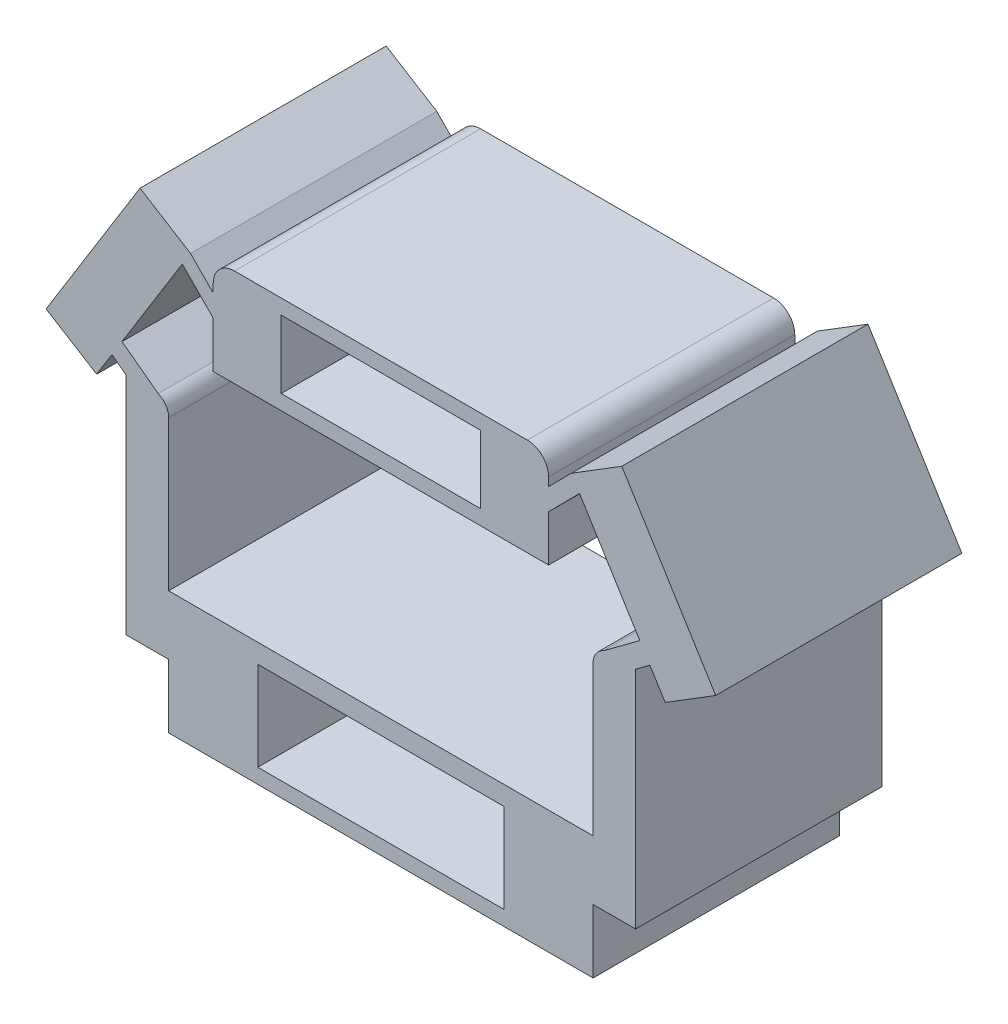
ISO-10303-21;
HEADER;
FILE_DESCRIPTION(('STEP AP214'),'2;1');
FILE_NAME('part.step','',(''),(''),'','','');
FILE_SCHEMA(('AUTOMOTIVE_DESIGN { 1 0 10303 214 1 1 1 1 }'));
ENDSEC;
DATA;
#1=APPLICATION_CONTEXT('core data for automotive mechanical design processes');
#2=APPLICATION_PROTOCOL_DEFINITION('international standard','automotive_design',2000,#1);
#3=PRODUCT_CONTEXT('',#1,'mechanical');
#4=PRODUCT('Part','Part','',(#3));
#5=PRODUCT_RELATED_PRODUCT_CATEGORY('part','',(#4));
#6=PRODUCT_DEFINITION_FORMATION('','',#4);
#7=PRODUCT_DEFINITION_CONTEXT('part definition',#1,'design');
#8=PRODUCT_DEFINITION('design','',#6,#7);
#9=PRODUCT_DEFINITION_SHAPE('','',#8);
#10=(LENGTH_UNIT() NAMED_UNIT(*) SI_UNIT(.MILLI.,.METRE.));
#11=(NAMED_UNIT(*) PLANE_ANGLE_UNIT() SI_UNIT($,.RADIAN.));
#12=(NAMED_UNIT(*) SI_UNIT($,.STERADIAN.) SOLID_ANGLE_UNIT());
#13=UNCERTAINTY_MEASURE_WITH_UNIT(LENGTH_MEASURE(1.E-05),#10,'distance_accuracy_value','');
#14=(GEOMETRIC_REPRESENTATION_CONTEXT(3) GLOBAL_UNCERTAINTY_ASSIGNED_CONTEXT((#13)) GLOBAL_UNIT_ASSIGNED_CONTEXT((#10,
#11,#12)) REPRESENTATION_CONTEXT('',''));
#15=CARTESIAN_POINT('',(0.,0.,0.));
#16=DIRECTION('',(0.,0.,1.));
#17=DIRECTION('',(1.,0.,0.));
#18=AXIS2_PLACEMENT_3D('',#15,#16,#17);
#19=CARTESIAN_POINT('',(5.,1.4,5.8));
#20=DIRECTION('',(1.,0.,0.));
#21=DIRECTION('',(0.,0.,-1.));
#22=AXIS2_PLACEMENT_3D('',#19,#20,#21);
#23=PLANE('',#22);
#24=DIRECTION('',(0.,-1.,0.));
#25=VECTOR('',#24,1.);
#26=CARTESIAN_POINT('',(5.,1.4,5.8));
#27=LINE('',#26,#25);
#28=CARTESIAN_POINT('',(5.,4.93114662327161,5.8));
#29=VERTEX_POINT('',#28);
#30=CARTESIAN_POINT('',(5.,1.4,5.8));
#31=VERTEX_POINT('',#30);
#32=EDGE_CURVE('E532',#29,#31,#27,.T.);
#33=ORIENTED_EDGE('',*,*,#32,.F.);
#34=DIRECTION('',(0.,0.,1.));
#35=VECTOR('',#34,1.);
#36=CARTESIAN_POINT('',(5.,4.93114662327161,5.8));
#37=LINE('',#36,#35);
#38=CARTESIAN_POINT('',(5.,4.93114662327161,0.));
#39=VERTEX_POINT('',#38);
#40=EDGE_CURVE('E11',#29,#39,#37,.F.);
#41=ORIENTED_EDGE('',*,*,#40,.T.);
#42=DIRECTION('',(0.,-1.,0.));
#43=VECTOR('',#42,1.);
#44=CARTESIAN_POINT('',(5.,1.4,0.));
#45=LINE('',#44,#43);
#46=CARTESIAN_POINT('',(5.,1.4,0.));
#47=VERTEX_POINT('',#46);
#48=EDGE_CURVE('E531',#39,#47,#45,.T.);
#49=ORIENTED_EDGE('',*,*,#48,.T.);
#50=DIRECTION('',(0.,0.,-1.));
#51=VECTOR('',#50,1.);
#52=CARTESIAN_POINT('',(5.,1.4,5.8));
#53=LINE('',#52,#51);
#54=EDGE_CURVE('E657',#31,#47,#53,.T.);
#55=ORIENTED_EDGE('',*,*,#54,.F.);
#56=EDGE_LOOP('',(#33,#41,#49,#55));
#57=FACE_BOUND('',#56,.T.);
#58=ADVANCED_FACE('F39',(#57),#23,.F.);
#59=CARTESIAN_POINT('',(-5.,1.4,5.8));
#60=DIRECTION('',(0.,-1.,0.));
#61=DIRECTION('',(1.,0.,0.));
#62=AXIS2_PLACEMENT_3D('',#59,#60,#61);
#63=PLANE('',#62);
#64=DIRECTION('',(-1.,0.,0.));
#65=VECTOR('',#64,1.);
#66=CARTESIAN_POINT('',(-5.,1.4,0.));
#67=LINE('',#66,#65);
#68=CARTESIAN_POINT('',(-5.,1.4,0.));
#69=VERTEX_POINT('',#68);
#70=EDGE_CURVE('E572',#47,#69,#67,.T.);
#71=ORIENTED_EDGE('',*,*,#70,.T.);
#72=DIRECTION('',(0.,0.,-1.));
#73=VECTOR('',#72,1.);
#74=CARTESIAN_POINT('',(-5.,1.4,5.8));
#75=LINE('',#74,#73);
#76=CARTESIAN_POINT('',(-5.,1.4,5.8));
#77=VERTEX_POINT('',#76);
#78=EDGE_CURVE('E654',#77,#69,#75,.T.);
#79=ORIENTED_EDGE('',*,*,#78,.F.);
#80=DIRECTION('',(-1.,0.,0.));
#81=VECTOR('',#80,1.);
#82=CARTESIAN_POINT('',(-5.,1.4,5.8));
#83=LINE('',#82,#81);
#84=EDGE_CURVE('E534',#31,#77,#83,.T.);
#85=ORIENTED_EDGE('',*,*,#84,.F.);
#86=ORIENTED_EDGE('',*,*,#54,.T.);
#87=EDGE_LOOP('',(#71,#79,#85,#86));
#88=FACE_BOUND('',#87,.T.);
#89=ADVANCED_FACE('F701',(#88),#63,.F.);
#90=CARTESIAN_POINT('',(-5.,-1.4,5.8));
#91=DIRECTION('',(1.,0.,0.));
#92=DIRECTION('',(0.,0.,-1.));
#93=AXIS2_PLACEMENT_3D('',#90,#91,#92);
#94=PLANE('',#93);
#95=DIRECTION('',(0.,-1.,0.));
#96=VECTOR('',#95,1.);
#97=CARTESIAN_POINT('',(-5.,-1.4,5.8));
#98=LINE('',#97,#96);
#99=CARTESIAN_POINT('',(-5.,0.,5.8));
#100=VERTEX_POINT('',#99);
#101=CARTESIAN_POINT('',(-5.,-1.5,5.8));
#102=VERTEX_POINT('',#101);
#103=EDGE_CURVE('E538',#100,#102,#98,.T.);
#104=ORIENTED_EDGE('',*,*,#103,.F.);
#105=DIRECTION('',(0.,0.,-1.));
#106=VECTOR('',#105,1.);
#107=CARTESIAN_POINT('',(-5.,0.,5.8));
#108=LINE('',#107,#106);
#109=CARTESIAN_POINT('',(-5.,0.,0.));
#110=VERTEX_POINT('',#109);
#111=EDGE_CURVE('E471',#100,#110,#108,.T.);
#112=ORIENTED_EDGE('',*,*,#111,.T.);
#113=DIRECTION('',(0.,-1.,0.));
#114=VECTOR('',#113,1.);
#115=CARTESIAN_POINT('',(-5.,-1.4,0.));
#116=LINE('',#115,#114);
#117=CARTESIAN_POINT('',(-5.,-1.5,0.));
#118=VERTEX_POINT('',#117);
#119=EDGE_CURVE('E575',#110,#118,#116,.T.);
#120=ORIENTED_EDGE('',*,*,#119,.T.);
#121=DIRECTION('',(0.,0.,1.));
#122=VECTOR('',#121,1.);
#123=CARTESIAN_POINT('',(-5.,-1.5,-10.0004999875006));
#124=LINE('',#123,#122);
#125=EDGE_CURVE('E374',#118,#102,#124,.T.);
#126=ORIENTED_EDGE('',*,*,#125,.T.);
#127=EDGE_LOOP('',(#104,#112,#120,#126));
#128=FACE_BOUND('',#127,.T.);
#129=ADVANCED_FACE('F757',(#128),#94,.F.);
#130=CARTESIAN_POINT('',(5.,-1.4,5.8));
#131=DIRECTION('',(-1.,0.,0.));
#132=DIRECTION('',(0.,0.,1.));
#133=AXIS2_PLACEMENT_3D('',#130,#131,#132);
#134=PLANE('',#133);
#135=DIRECTION('',(0.,1.,0.));
#136=VECTOR('',#135,1.);
#137=CARTESIAN_POINT('',(5.,-1.4,0.));
#138=LINE('',#137,#136);
#139=CARTESIAN_POINT('',(5.,-1.5,0.));
#140=VERTEX_POINT('',#139);
#141=CARTESIAN_POINT('',(5.,0.,0.));
#142=VERTEX_POINT('',#141);
#143=EDGE_CURVE('E577',#140,#142,#138,.T.);
#144=ORIENTED_EDGE('',*,*,#143,.T.);
#145=DIRECTION('',(0.,0.,-1.));
#146=VECTOR('',#145,1.);
#147=CARTESIAN_POINT('',(5.,0.,5.8));
#148=LINE('',#147,#146);
#149=CARTESIAN_POINT('',(5.,0.,5.8));
#150=VERTEX_POINT('',#149);
#151=EDGE_CURVE('E651',#150,#142,#148,.T.);
#152=ORIENTED_EDGE('',*,*,#151,.F.);
#153=DIRECTION('',(0.,1.,0.));
#154=VECTOR('',#153,1.);
#155=CARTESIAN_POINT('',(5.,-1.4,5.8));
#156=LINE('',#155,#154);
#157=CARTESIAN_POINT('',(5.,-1.5,5.8));
#158=VERTEX_POINT('',#157);
#159=EDGE_CURVE('E540',#158,#150,#156,.T.);
#160=ORIENTED_EDGE('',*,*,#159,.F.);
#161=DIRECTION('',(0.,0.,1.));
#162=VECTOR('',#161,1.);
#163=CARTESIAN_POINT('',(5.,-1.5,-10.0004999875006));
#164=LINE('',#163,#162);
#165=EDGE_CURVE('E371',#140,#158,#164,.T.);
#166=ORIENTED_EDGE('',*,*,#165,.F.);
#167=EDGE_LOOP('',(#144,#152,#160,#166));
#168=FACE_BOUND('',#167,.T.);
#169=ADVANCED_FACE('F878',(#168),#134,.F.);
#170=CARTESIAN_POINT('',(5.,0.,5.8));
#171=DIRECTION('',(0.,1.,0.));
#172=DIRECTION('',(-1.,0.,0.));
#173=AXIS2_PLACEMENT_3D('',#170,#171,#172);
#174=PLANE('',#173);
#175=DIRECTION('',(1.,0.,0.));
#176=VECTOR('',#175,1.);
#177=CARTESIAN_POINT('',(5.,0.,0.));
#178=LINE('',#177,#176);
#179=CARTESIAN_POINT('',(6.,0.,0.));
#180=VERTEX_POINT('',#179);
#181=EDGE_CURVE('E579',#142,#180,#178,.T.);
#182=ORIENTED_EDGE('',*,*,#181,.T.);
#183=DIRECTION('',(0.,0.,-1.));
#184=VECTOR('',#183,1.);
#185=CARTESIAN_POINT('',(6.,0.,5.8));
#186=LINE('',#185,#184);
#187=CARTESIAN_POINT('',(6.,0.,5.8));
#188=VERTEX_POINT('',#187);
#189=EDGE_CURVE('E648',#188,#180,#186,.T.);
#190=ORIENTED_EDGE('',*,*,#189,.F.);
#191=DIRECTION('',(1.,0.,0.));
#192=VECTOR('',#191,1.);
#193=CARTESIAN_POINT('',(5.,0.,5.8));
#194=LINE('',#193,#192);
#195=EDGE_CURVE('E542',#150,#188,#194,.T.);
#196=ORIENTED_EDGE('',*,*,#195,.F.);
#197=ORIENTED_EDGE('',*,*,#151,.T.);
#198=EDGE_LOOP('',(#182,#190,#196,#197));
#199=FACE_BOUND('',#198,.T.);
#200=ADVANCED_FACE('F885',(#199),#174,.F.);
#201=CARTESIAN_POINT('',(6.,5.3,5.8));
#202=DIRECTION('',(-1.,0.,0.));
#203=DIRECTION('',(0.,-1.,0.));
#204=AXIS2_PLACEMENT_3D('',#201,#202,#203);
#205=PLANE('',#204);
#206=DIRECTION('',(0.,1.,0.));
#207=VECTOR('',#206,1.);
#208=CARTESIAN_POINT('',(6.,5.3,0.));
#209=LINE('',#208,#207);
#210=CARTESIAN_POINT('',(6.,5.3,0.));
#211=VERTEX_POINT('',#210);
#212=EDGE_CURVE('E581',#180,#211,#209,.T.);
#213=ORIENTED_EDGE('',*,*,#212,.T.);
#214=DIRECTION('',(0.,0.,-1.));
#215=VECTOR('',#214,1.);
#216=CARTESIAN_POINT('',(6.,5.3,5.8));
#217=LINE('',#216,#215);
#218=CARTESIAN_POINT('',(6.,5.3,5.8));
#219=VERTEX_POINT('',#218);
#220=EDGE_CURVE('E645',#219,#211,#217,.T.);
#221=ORIENTED_EDGE('',*,*,#220,.F.);
#222=DIRECTION('',(0.,1.,0.));
#223=VECTOR('',#222,1.);
#224=CARTESIAN_POINT('',(6.,5.3,5.8));
#225=LINE('',#224,#223);
#226=EDGE_CURVE('E544',#188,#219,#225,.T.);
#227=ORIENTED_EDGE('',*,*,#226,.F.);
#228=ORIENTED_EDGE('',*,*,#189,.T.);
#229=EDGE_LOOP('',(#213,#221,#227,#228));
#230=FACE_BOUND('',#229,.T.);
#231=ADVANCED_FACE('F889',(#230),#205,.F.);
#232=CARTESIAN_POINT('',(6.,5.3,5.8));
#233=DIRECTION('',(-0.596224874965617,0.802817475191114,0.));
#234=DIRECTION('',(-0.802817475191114,-0.596224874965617,0.));
#235=AXIS2_PLACEMENT_3D('',#232,#233,#234);
#236=PLANE('',#235);
#237=DIRECTION('',(0.802817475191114,0.596224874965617,0.));
#238=VECTOR('',#237,1.);
#239=CARTESIAN_POINT('',(6.,5.3,0.));
#240=LINE('',#239,#238);
#241=CARTESIAN_POINT('',(6.33718333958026,5.55041444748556,0.));
#242=VERTEX_POINT('',#241);
#243=EDGE_CURVE('E583',#211,#242,#240,.T.);
#244=ORIENTED_EDGE('',*,*,#243,.T.);
#245=DIRECTION('',(0.,0.,-1.));
#246=VECTOR('',#245,1.);
#247=CARTESIAN_POINT('',(6.33718333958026,5.55041444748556,5.8));
#248=LINE('',#247,#246);
#249=CARTESIAN_POINT('',(6.33718333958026,5.55041444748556,5.8));
#250=VERTEX_POINT('',#249);
#251=EDGE_CURVE('E642',#250,#242,#248,.T.);
#252=ORIENTED_EDGE('',*,*,#251,.F.);
#253=DIRECTION('',(0.802817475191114,0.596224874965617,0.));
#254=VECTOR('',#253,1.);
#255=CARTESIAN_POINT('',(6.,5.3,5.8));
#256=LINE('',#255,#254);
#257=EDGE_CURVE('E546',#219,#250,#256,.T.);
#258=ORIENTED_EDGE('',*,*,#257,.F.);
#259=ORIENTED_EDGE('',*,*,#220,.T.);
#260=EDGE_LOOP('',(#244,#252,#258,#259));
#261=FACE_BOUND('',#260,.T.);
#262=ADVANCED_FACE('F894',(#261),#236,.F.);
#263=CARTESIAN_POINT('',(6.33718333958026,5.55041444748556,5.8));
#264=DIRECTION('',(0.850038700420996,0.526720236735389,0.));
#265=DIRECTION('',(-0.526720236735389,0.850038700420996,0.));
#266=AXIS2_PLACEMENT_3D('',#263,#264,#265);
#267=PLANE('',#266);
#268=DIRECTION('',(0.526720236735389,-0.850038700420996,0.));
#269=VECTOR('',#268,1.);
#270=CARTESIAN_POINT('',(6.33718333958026,5.55041444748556,0.));
#271=LINE('',#270,#269);
#272=CARTESIAN_POINT('',(6.69680496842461,4.97004505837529,0.));
#273=VERTEX_POINT('',#272);
#274=EDGE_CURVE('E585',#242,#273,#271,.T.);
#275=ORIENTED_EDGE('',*,*,#274,.T.);
#276=DIRECTION('',(0.,0.,-1.));
#277=VECTOR('',#276,1.);
#278=CARTESIAN_POINT('',(6.69680496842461,4.97004505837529,5.8));
#279=LINE('',#278,#277);
#280=CARTESIAN_POINT('',(6.69680496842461,4.97004505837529,5.8));
#281=VERTEX_POINT('',#280);
#282=EDGE_CURVE('E639',#281,#273,#279,.T.);
#283=ORIENTED_EDGE('',*,*,#282,.F.);
#284=DIRECTION('',(0.526720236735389,-0.850038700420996,0.));
#285=VECTOR('',#284,1.);
#286=CARTESIAN_POINT('',(6.33718333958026,5.55041444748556,5.8));
#287=LINE('',#286,#285);
#288=EDGE_CURVE('E548',#250,#281,#287,.T.);
#289=ORIENTED_EDGE('',*,*,#288,.F.);
#290=ORIENTED_EDGE('',*,*,#251,.T.);
#291=EDGE_LOOP('',(#275,#283,#289,#290));
#292=FACE_BOUND('',#291,.T.);
#293=ADVANCED_FACE('F900',(#292),#267,.F.);
#294=CARTESIAN_POINT('',(6.69680496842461,4.97004505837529,5.8));
#295=DIRECTION('',(-0.526720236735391,0.850038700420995,0.));
#296=DIRECTION('',(-0.850038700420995,-0.526720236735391,0.));
#297=AXIS2_PLACEMENT_3D('',#294,#295,#296);
#298=PLANE('',#297);
#299=DIRECTION('',(0.850038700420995,0.526720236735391,0.));
#300=VECTOR('',#299,1.);
#301=CARTESIAN_POINT('',(6.69680496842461,4.97004505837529,0.));
#302=LINE('',#301,#300);
#303=CARTESIAN_POINT('',(7.88685914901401,5.70745338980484,0.));
#304=VERTEX_POINT('',#303);
#305=EDGE_CURVE('E587',#273,#304,#302,.T.);
#306=ORIENTED_EDGE('',*,*,#305,.T.);
#307=DIRECTION('',(0.,0.,-1.));
#308=VECTOR('',#307,1.);
#309=CARTESIAN_POINT('',(7.88685914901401,5.70745338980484,5.8));
#310=LINE('',#309,#308);
#311=CARTESIAN_POINT('',(7.88685914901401,5.70745338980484,5.8));
#312=VERTEX_POINT('',#311);
#313=EDGE_CURVE('E636',#312,#304,#310,.T.);
#314=ORIENTED_EDGE('',*,*,#313,.F.);
#315=DIRECTION('',(0.850038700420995,0.526720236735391,0.));
#316=VECTOR('',#315,1.);
#317=CARTESIAN_POINT('',(6.69680496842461,4.97004505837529,5.8));
#318=LINE('',#317,#316);
#319=EDGE_CURVE('E550',#281,#312,#318,.T.);
#320=ORIENTED_EDGE('',*,*,#319,.F.);
#321=ORIENTED_EDGE('',*,*,#282,.T.);
#322=EDGE_LOOP('',(#306,#314,#320,#321));
#323=FACE_BOUND('',#322,.T.);
#324=ADVANCED_FACE('F904',(#323),#298,.F.);
#325=CARTESIAN_POINT('',(5.67463415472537,9.27761593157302,5.8));
#326=DIRECTION('',(-0.850038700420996,-0.526720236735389,0.));
#327=DIRECTION('',(0.526720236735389,-0.850038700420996,0.));
#328=AXIS2_PLACEMENT_3D('',#325,#326,#327);
#329=PLANE('',#328);
#330=DIRECTION('',(-0.526720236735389,0.850038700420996,0.));
#331=VECTOR('',#330,1.);
#332=CARTESIAN_POINT('',(5.67463415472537,9.27761593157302,0.));
#333=LINE('',#332,#331);
#334=CARTESIAN_POINT('',(5.67463415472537,9.27761593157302,0.));
#335=VERTEX_POINT('',#334);
#336=EDGE_CURVE('E589',#304,#335,#333,.T.);
#337=ORIENTED_EDGE('',*,*,#336,.T.);
#338=DIRECTION('',(0.,0.,-1.));
#339=VECTOR('',#338,1.);
#340=CARTESIAN_POINT('',(5.67463415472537,9.27761593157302,5.8));
#341=LINE('',#340,#339);
#342=CARTESIAN_POINT('',(5.67463415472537,9.27761593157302,5.8));
#343=VERTEX_POINT('',#342);
#344=EDGE_CURVE('E633',#343,#335,#341,.T.);
#345=ORIENTED_EDGE('',*,*,#344,.F.);
#346=DIRECTION('',(-0.526720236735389,0.850038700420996,0.));
#347=VECTOR('',#346,1.);
#348=CARTESIAN_POINT('',(5.67463415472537,9.27761593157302,5.8));
#349=LINE('',#348,#347);
#350=EDGE_CURVE('E552',#312,#343,#349,.T.);
#351=ORIENTED_EDGE('',*,*,#350,.F.);
#352=ORIENTED_EDGE('',*,*,#313,.T.);
#353=EDGE_LOOP('',(#337,#345,#351,#352));
#354=FACE_BOUND('',#353,.T.);
#355=ADVANCED_FACE('F909',(#354),#329,.F.);
#356=CARTESIAN_POINT('',(5.67463415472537,9.27761593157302,5.8));
#357=DIRECTION('',(0.52672023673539,-0.850038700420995,0.));
#358=DIRECTION('',(0.850038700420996,0.52672023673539,0.));
#359=AXIS2_PLACEMENT_3D('',#356,#357,#358);
#360=PLANE('',#359);
#361=DIRECTION('',(-0.850038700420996,-0.52672023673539,0.));
#362=VECTOR('',#361,1.);
#363=CARTESIAN_POINT('',(5.67463415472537,9.27761593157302,0.));
#364=LINE('',#363,#362);
#365=CARTESIAN_POINT('',(4.48457997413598,8.54020760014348,0.));
#366=VERTEX_POINT('',#365);
#367=EDGE_CURVE('E591',#335,#366,#364,.T.);
#368=ORIENTED_EDGE('',*,*,#367,.T.);
#369=DIRECTION('',(0.,0.,-1.));
#370=VECTOR('',#369,1.);
#371=CARTESIAN_POINT('',(4.48457997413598,8.54020760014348,5.8));
#372=LINE('',#371,#370);
#373=CARTESIAN_POINT('',(4.48457997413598,8.54020760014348,5.8));
#374=VERTEX_POINT('',#373);
#375=EDGE_CURVE('E630',#374,#366,#372,.T.);
#376=ORIENTED_EDGE('',*,*,#375,.F.);
#377=DIRECTION('',(-0.850038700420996,-0.52672023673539,0.));
#378=VECTOR('',#377,1.);
#379=CARTESIAN_POINT('',(5.67463415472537,9.27761593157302,5.8));
#380=LINE('',#379,#378);
#381=EDGE_CURVE('E554',#343,#374,#380,.T.);
#382=ORIENTED_EDGE('',*,*,#381,.F.);
#383=ORIENTED_EDGE('',*,*,#344,.T.);
#384=EDGE_LOOP('',(#368,#376,#382,#383));
#385=FACE_BOUND('',#384,.T.);
#386=ADVANCED_FACE('F915',(#385),#360,.F.);
#387=CARTESIAN_POINT('',(3.95,8.,5.8));
#388=DIRECTION('',(0.710799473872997,-0.703394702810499,0.));
#389=DIRECTION('',(0.703394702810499,0.710799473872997,0.));
#390=AXIS2_PLACEMENT_3D('',#387,#388,#389);
#391=PLANE('',#390);
#392=DIRECTION('',(-0.703394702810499,-0.710799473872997,0.));
#393=VECTOR('',#392,1.);
#394=CARTESIAN_POINT('',(3.95,8.,0.));
#395=LINE('',#394,#393);
#396=CARTESIAN_POINT('',(3.95,8.,0.));
#397=VERTEX_POINT('',#396);
#398=EDGE_CURVE('E593',#366,#397,#395,.T.);
#399=ORIENTED_EDGE('',*,*,#398,.T.);
#400=DIRECTION('',(0.,0.,-1.));
#401=VECTOR('',#400,1.);
#402=CARTESIAN_POINT('',(3.95,8.,5.8));
#403=LINE('',#402,#401);
#404=CARTESIAN_POINT('',(3.95,8.,5.8));
#405=VERTEX_POINT('',#404);
#406=EDGE_CURVE('E627',#405,#397,#403,.T.);
#407=ORIENTED_EDGE('',*,*,#406,.F.);
#408=DIRECTION('',(-0.703394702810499,-0.710799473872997,0.));
#409=VECTOR('',#408,1.);
#410=CARTESIAN_POINT('',(3.95,8.,5.8));
#411=LINE('',#410,#409);
#412=EDGE_CURVE('E556',#374,#405,#411,.T.);
#413=ORIENTED_EDGE('',*,*,#412,.F.);
#414=ORIENTED_EDGE('',*,*,#375,.T.);
#415=EDGE_LOOP('',(#399,#407,#413,#414));
#416=FACE_BOUND('',#415,.T.);
#417=ADVANCED_FACE('F919',(#416),#391,.F.);
#418=CARTESIAN_POINT('',(-3.95,8.,5.8));
#419=DIRECTION('',(1.,0.,0.));
#420=DIRECTION('',(0.,0.,-1.));
#421=AXIS2_PLACEMENT_3D('',#418,#419,#420);
#422=PLANE('',#421);
#423=DIRECTION('',(0.,-1.,0.));
#424=VECTOR('',#423,1.);
#425=CARTESIAN_POINT('',(-3.95,8.,5.8));
#426=LINE('',#425,#424);
#427=CARTESIAN_POINT('',(-3.95,7.48819631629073,5.8));
#428=VERTEX_POINT('',#427);
#429=CARTESIAN_POINT('',(-3.95,6.4,5.8));
#430=VERTEX_POINT('',#429);
#431=EDGE_CURVE('E558',#428,#430,#426,.T.);
#432=ORIENTED_EDGE('',*,*,#431,.F.);
#433=DIRECTION('',(0.,0.,-1.));
#434=VECTOR('',#433,1.);
#435=CARTESIAN_POINT('',(-3.95,7.48819631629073,5.8));
#436=LINE('',#435,#434);
#437=CARTESIAN_POINT('',(-3.95,7.48819631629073,0.));
#438=VERTEX_POINT('',#437);
#439=EDGE_CURVE('E521',#428,#438,#436,.T.);
#440=ORIENTED_EDGE('',*,*,#439,.T.);
#441=DIRECTION('',(0.,-1.,0.));
#442=VECTOR('',#441,1.);
#443=CARTESIAN_POINT('',(-3.95,8.,0.));
#444=LINE('',#443,#442);
#445=CARTESIAN_POINT('',(-3.95,6.4,0.));
#446=VERTEX_POINT('',#445);
#447=EDGE_CURVE('E595',#438,#446,#444,.T.);
#448=ORIENTED_EDGE('',*,*,#447,.T.);
#449=DIRECTION('',(0.,0.,-1.));
#450=VECTOR('',#449,1.);
#451=CARTESIAN_POINT('',(-3.95,6.4,5.8));
#452=LINE('',#451,#450);
#453=EDGE_CURVE('E621',#430,#446,#452,.T.);
#454=ORIENTED_EDGE('',*,*,#453,.F.);
#455=EDGE_LOOP('',(#432,#440,#448,#454));
#456=FACE_BOUND('',#455,.T.);
#457=ADVANCED_FACE('F734',(#456),#422,.F.);
#458=CARTESIAN_POINT('',(-3.95,6.4,5.8));
#459=DIRECTION('',(0.,1.,0.));
#460=DIRECTION('',(0.,0.,1.));
#461=AXIS2_PLACEMENT_3D('',#458,#459,#460);
#462=PLANE('',#461);
#463=DIRECTION('',(1.,0.,0.));
#464=VECTOR('',#463,1.);
#465=CARTESIAN_POINT('',(-3.95,6.4,0.));
#466=LINE('',#465,#464);
#467=CARTESIAN_POINT('',(3.95,6.4,0.));
#468=VERTEX_POINT('',#467);
#469=EDGE_CURVE('E597',#446,#468,#466,.T.);
#470=ORIENTED_EDGE('',*,*,#469,.T.);
#471=DIRECTION('',(0.,0.,-1.));
#472=VECTOR('',#471,1.);
#473=CARTESIAN_POINT('',(3.95,6.4,5.8));
#474=LINE('',#473,#472);
#475=CARTESIAN_POINT('',(3.95,6.4,5.8));
#476=VERTEX_POINT('',#475);
#477=EDGE_CURVE('E618',#476,#468,#474,.T.);
#478=ORIENTED_EDGE('',*,*,#477,.F.);
#479=DIRECTION('',(1.,0.,0.));
#480=VECTOR('',#479,1.);
#481=CARTESIAN_POINT('',(-3.95,6.4,5.8));
#482=LINE('',#481,#480);
#483=EDGE_CURVE('E560',#430,#476,#482,.T.);
#484=ORIENTED_EDGE('',*,*,#483,.F.);
#485=ORIENTED_EDGE('',*,*,#453,.T.);
#486=EDGE_LOOP('',(#470,#478,#484,#485));
#487=FACE_BOUND('',#486,.T.);
#488=ADVANCED_FACE('F730',(#487),#462,.F.);
#489=CARTESIAN_POINT('',(3.95,7.48819631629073,5.8));
#490=DIRECTION('',(-1.,0.,0.));
#491=DIRECTION('',(0.,0.,1.));
#492=AXIS2_PLACEMENT_3D('',#489,#490,#491);
#493=PLANE('',#492);
#494=DIRECTION('',(0.,1.,0.));
#495=VECTOR('',#494,1.);
#496=CARTESIAN_POINT('',(3.95,7.48819631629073,0.));
#497=LINE('',#496,#495);
#498=CARTESIAN_POINT('',(3.95,7.48819631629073,0.));
#499=VERTEX_POINT('',#498);
#500=EDGE_CURVE('E599',#468,#499,#497,.T.);
#501=ORIENTED_EDGE('',*,*,#500,.T.);
#502=DIRECTION('',(0.,0.,-1.));
#503=VECTOR('',#502,1.);
#504=CARTESIAN_POINT('',(3.95,7.48819631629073,5.8));
#505=LINE('',#504,#503);
#506=CARTESIAN_POINT('',(3.95,7.48819631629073,5.8));
#507=VERTEX_POINT('',#506);
#508=EDGE_CURVE('E615',#507,#499,#505,.T.);
#509=ORIENTED_EDGE('',*,*,#508,.F.);
#510=DIRECTION('',(0.,1.,0.));
#511=VECTOR('',#510,1.);
#512=CARTESIAN_POINT('',(3.95,7.48819631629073,5.8));
#513=LINE('',#512,#511);
#514=EDGE_CURVE('E562',#476,#507,#513,.T.);
#515=ORIENTED_EDGE('',*,*,#514,.F.);
#516=ORIENTED_EDGE('',*,*,#477,.T.);
#517=EDGE_LOOP('',(#501,#509,#515,#516));
#518=FACE_BOUND('',#517,.T.);
#519=ADVANCED_FACE('F726',(#518),#493,.F.);
#520=CARTESIAN_POINT('',(3.95,7.48819631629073,5.8));
#521=DIRECTION('',(-0.710799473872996,0.7033947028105,0.));
#522=DIRECTION('',(-0.7033947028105,-0.710799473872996,0.));
#523=AXIS2_PLACEMENT_3D('',#520,#521,#522);
#524=PLANE('',#523);
#525=DIRECTION('',(0.7033947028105,0.710799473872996,0.));
#526=VECTOR('',#525,1.);
#527=CARTESIAN_POINT('',(3.95,7.48819631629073,0.));
#528=LINE('',#527,#526);
#529=CARTESIAN_POINT('',(4.67960031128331,8.22547727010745,0.));
#530=VERTEX_POINT('',#529);
#531=EDGE_CURVE('E601',#499,#530,#528,.T.);
#532=ORIENTED_EDGE('',*,*,#531,.T.);
#533=DIRECTION('',(0.,0.,-1.));
#534=VECTOR('',#533,1.);
#535=CARTESIAN_POINT('',(4.67960031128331,8.22547727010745,5.8));
#536=LINE('',#535,#534);
#537=CARTESIAN_POINT('',(4.67960031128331,8.22547727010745,5.8));
#538=VERTEX_POINT('',#537);
#539=EDGE_CURVE('E612',#538,#530,#536,.T.);
#540=ORIENTED_EDGE('',*,*,#539,.F.);
#541=DIRECTION('',(0.7033947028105,0.710799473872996,0.));
#542=VECTOR('',#541,1.);
#543=CARTESIAN_POINT('',(3.95,7.48819631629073,5.8));
#544=LINE('',#543,#542);
#545=EDGE_CURVE('E564',#507,#538,#544,.T.);
#546=ORIENTED_EDGE('',*,*,#545,.F.);
#547=ORIENTED_EDGE('',*,*,#508,.T.);
#548=EDGE_LOOP('',(#532,#540,#546,#547));
#549=FACE_BOUND('',#548,.T.);
#550=ADVANCED_FACE('F722',(#549),#524,.F.);
#551=CARTESIAN_POINT('',(4.67960031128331,8.22547727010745,5.8));
#552=DIRECTION('',(0.850038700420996,0.52672023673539,0.));
#553=DIRECTION('',(-0.52672023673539,0.850038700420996,0.));
#554=AXIS2_PLACEMENT_3D('',#551,#552,#553);
#555=PLANE('',#554);
#556=DIRECTION('',(0.52672023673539,-0.850038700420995,0.));
#557=VECTOR('',#556,1.);
#558=CARTESIAN_POINT('',(4.67960031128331,8.22547727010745,0.));
#559=LINE('',#558,#557);
#560=CARTESIAN_POINT('',(6.09931948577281,5.93428707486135,0.));
#561=VERTEX_POINT('',#560);
#562=EDGE_CURVE('E603',#530,#561,#559,.T.);
#563=ORIENTED_EDGE('',*,*,#562,.T.);
#564=DIRECTION('',(0.,0.,-1.));
#565=VECTOR('',#564,1.);
#566=CARTESIAN_POINT('',(6.09931948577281,5.93428707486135,5.8));
#567=LINE('',#566,#565);
#568=CARTESIAN_POINT('',(6.09931948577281,5.93428707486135,5.8));
#569=VERTEX_POINT('',#568);
#570=EDGE_CURVE('E609',#569,#561,#567,.T.);
#571=ORIENTED_EDGE('',*,*,#570,.F.);
#572=DIRECTION('',(0.52672023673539,-0.850038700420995,0.));
#573=VECTOR('',#572,1.);
#574=CARTESIAN_POINT('',(4.67960031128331,8.22547727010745,5.8));
#575=LINE('',#574,#573);
#576=EDGE_CURVE('E566',#538,#569,#575,.T.);
#577=ORIENTED_EDGE('',*,*,#576,.F.);
#578=ORIENTED_EDGE('',*,*,#539,.T.);
#579=EDGE_LOOP('',(#563,#571,#577,#578));
#580=FACE_BOUND('',#579,.T.);
#581=ADVANCED_FACE('F717',(#580),#555,.F.);
#582=CARTESIAN_POINT('',(5.24525121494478,5.3,5.8));
#583=DIRECTION('',(0.596224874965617,-0.802817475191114,0.));
#584=DIRECTION('',(0.802817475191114,0.596224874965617,0.));
#585=AXIS2_PLACEMENT_3D('',#582,#583,#584);
#586=PLANE('',#585);
#587=DIRECTION('',(-0.802817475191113,-0.596224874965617,0.));
#588=VECTOR('',#587,1.);
#589=CARTESIAN_POINT('',(5.24525121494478,5.3,0.));
#590=LINE('',#589,#588);
#591=CARTESIAN_POINT('',(5.24525121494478,5.3,0.));
#592=VERTEX_POINT('',#591);
#593=EDGE_CURVE('E535',#561,#592,#590,.T.);
#594=ORIENTED_EDGE('',*,*,#593,.T.);
#595=DIRECTION('',(0.,0.,-1.));
#596=VECTOR('',#595,1.);
#597=CARTESIAN_POINT('',(5.24525121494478,5.3,5.8));
#598=LINE('',#597,#596);
#599=CARTESIAN_POINT('',(5.24525121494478,5.3,5.8));
#600=VERTEX_POINT('',#599);
#601=EDGE_CURVE('E570',#600,#592,#598,.T.);
#602=ORIENTED_EDGE('',*,*,#601,.F.);
#603=DIRECTION('',(-0.802817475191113,-0.596224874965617,0.));
#604=VECTOR('',#603,1.);
#605=CARTESIAN_POINT('',(5.24525121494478,5.3,5.8));
#606=LINE('',#605,#604);
#607=EDGE_CURVE('E568',#569,#600,#606,.T.);
#608=ORIENTED_EDGE('',*,*,#607,.F.);
#609=ORIENTED_EDGE('',*,*,#570,.T.);
#610=EDGE_LOOP('',(#594,#602,#608,#609));
#611=FACE_BOUND('',#610,.T.);
#612=ADVANCED_FACE('F711',(#611),#586,.F.);
#613=CARTESIAN_POINT('',(0.,0.,5.8));
#614=DIRECTION('',(0.,0.,-1.));
#615=DIRECTION('',(-1.,0.,0.));
#616=AXIS2_PLACEMENT_3D('',#613,#614,#615);
#617=PLANE('',#616);
#618=DIRECTION('',(1.,0.,0.));
#619=VECTOR('',#618,1.);
#620=CARTESIAN_POINT('',(-2.9,-1.15,5.8));
#621=LINE('',#620,#619);
#622=CARTESIAN_POINT('',(-2.9,-1.15,5.8));
#623=VERTEX_POINT('',#622);
#624=CARTESIAN_POINT('',(2.9,-1.15,5.8));
#625=VERTEX_POINT('',#624);
#626=EDGE_CURVE('E360',#623,#625,#621,.T.);
#627=ORIENTED_EDGE('',*,*,#626,.F.);
#628=DIRECTION('',(0.,-1.,0.));
#629=VECTOR('',#628,1.);
#630=CARTESIAN_POINT('',(-2.9,-1.05,5.8));
#631=LINE('',#630,#629);
#632=CARTESIAN_POINT('',(-2.9,0.95,5.8));
#633=VERTEX_POINT('',#632);
#634=EDGE_CURVE('E351',#633,#623,#631,.T.);
#635=ORIENTED_EDGE('',*,*,#634,.F.);
#636=DIRECTION('',(1.,0.,0.));
#637=VECTOR('',#636,1.);
#638=CARTESIAN_POINT('',(-2.9,0.95,5.8));
#639=LINE('',#638,#637);
#640=CARTESIAN_POINT('',(2.9,0.95,5.8));
#641=VERTEX_POINT('',#640);
#642=EDGE_CURVE('E377',#633,#641,#639,.T.);
#643=ORIENTED_EDGE('',*,*,#642,.T.);
#644=DIRECTION('',(0.,1.,0.));
#645=VECTOR('',#644,1.);
#646=CARTESIAN_POINT('',(2.9,-1.05,5.8));
#647=LINE('',#646,#645);
#648=EDGE_CURVE('E416',#625,#641,#647,.T.);
#649=ORIENTED_EDGE('',*,*,#648,.F.);
#650=EDGE_LOOP('',(#627,#635,#643,#649));
#651=FACE_BOUND('',#650,.T.);
#652=DIRECTION('',(1.,0.,0.));
#653=VECTOR('',#652,1.);
#654=CARTESIAN_POINT('',(2.35,8.35,5.8));
#655=LINE('',#654,#653);
#656=CARTESIAN_POINT('',(-2.35,8.35,5.8));
#657=VERTEX_POINT('',#656);
#658=CARTESIAN_POINT('',(2.35,8.35,5.8));
#659=VERTEX_POINT('',#658);
#660=EDGE_CURVE('E386',#657,#659,#655,.T.);
#661=ORIENTED_EDGE('',*,*,#660,.T.);
#662=DIRECTION('',(0.,1.,0.));
#663=VECTOR('',#662,1.);
#664=CARTESIAN_POINT('',(2.35,8.35,5.8));
#665=LINE('',#664,#663);
#666=CARTESIAN_POINT('',(2.35,6.75,5.8));
#667=VERTEX_POINT('',#666);
#668=EDGE_CURVE('E424',#667,#659,#665,.T.);
#669=ORIENTED_EDGE('',*,*,#668,.F.);
#670=DIRECTION('',(1.,0.,0.));
#671=VECTOR('',#670,1.);
#672=CARTESIAN_POINT('',(-2.35,6.75,5.8));
#673=LINE('',#672,#671);
#674=CARTESIAN_POINT('',(-2.35,6.75,5.8));
#675=VERTEX_POINT('',#674);
#676=EDGE_CURVE('E428',#675,#667,#673,.T.);
#677=ORIENTED_EDGE('',*,*,#676,.F.);
#678=DIRECTION('',(0.,-1.,0.));
#679=VECTOR('',#678,1.);
#680=CARTESIAN_POINT('',(-2.35,8.35000000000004,5.8));
#681=LINE('',#680,#679);
#682=EDGE_CURVE('E414',#657,#675,#681,.T.);
#683=ORIENTED_EDGE('',*,*,#682,.F.);
#684=EDGE_LOOP('',(#661,#669,#677,#683));
#685=FACE_BOUND('',#684,.T.);
#686=DIRECTION('',(-1.,0.,0.));
#687=VECTOR('',#686,1.);
#688=CARTESIAN_POINT('',(-3.95,8.7,5.8));
#689=LINE('',#688,#687);
#690=CARTESIAN_POINT('',(3.45,8.7,5.8));
#691=VERTEX_POINT('',#690);
#692=CARTESIAN_POINT('',(-3.45,8.7,5.8));
#693=VERTEX_POINT('',#692);
#694=EDGE_CURVE('E390',#691,#693,#689,.T.);
#695=ORIENTED_EDGE('',*,*,#694,.T.);
#696=CARTESIAN_POINT('',(-3.45,8.2,5.8));
#697=DIRECTION('',(0.,0.,-1.));
#698=DIRECTION('',(-1.,0.,0.));
#699=AXIS2_PLACEMENT_3D('',#696,#697,#698);
#700=CIRCLE('',#699,0.5);
#701=CARTESIAN_POINT('',(-3.95,8.2,5.8));
#702=VERTEX_POINT('',#701);
#703=EDGE_CURVE('E669',#693,#702,#700,.F.);
#704=ORIENTED_EDGE('',*,*,#703,.T.);
#705=DIRECTION('',(0.,-1.,0.));
#706=VECTOR('',#705,1.);
#707=CARTESIAN_POINT('',(-3.95,8.,5.8));
#708=LINE('',#707,#706);
#709=CARTESIAN_POINT('',(-3.95,8.,5.8));
#710=VERTEX_POINT('',#709);
#711=EDGE_CURVE('E387',#702,#710,#708,.T.);
#712=ORIENTED_EDGE('',*,*,#711,.T.);
#713=DIRECTION('',(0.703394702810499,-0.710799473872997,0.));
#714=VECTOR('',#713,1.);
#715=CARTESIAN_POINT('',(-3.95,8.,5.8));
#716=LINE('',#715,#714);
#717=CARTESIAN_POINT('',(-4.48457997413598,8.54020760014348,5.8));
#718=VERTEX_POINT('',#717);
#719=EDGE_CURVE('E447',#718,#710,#716,.T.);
#720=ORIENTED_EDGE('',*,*,#719,.F.);
#721=DIRECTION('',(0.850038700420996,-0.52672023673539,0.));
#722=VECTOR('',#721,1.);
#723=CARTESIAN_POINT('',(-5.67463415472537,9.27761593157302,5.8));
#724=LINE('',#723,#722);
#725=CARTESIAN_POINT('',(-5.67463415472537,9.27761593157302,5.8));
#726=VERTEX_POINT('',#725);
#727=EDGE_CURVE('E450',#726,#718,#724,.T.);
#728=ORIENTED_EDGE('',*,*,#727,.F.);
#729=DIRECTION('',(0.526720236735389,0.850038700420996,0.));
#730=VECTOR('',#729,1.);
#731=CARTESIAN_POINT('',(-5.67463415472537,9.27761593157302,5.8));
#732=LINE('',#731,#730);
#733=CARTESIAN_POINT('',(-7.88685914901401,5.70745338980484,5.8));
#734=VERTEX_POINT('',#733);
#735=EDGE_CURVE('E453',#734,#726,#732,.T.);
#736=ORIENTED_EDGE('',*,*,#735,.F.);
#737=DIRECTION('',(-0.850038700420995,0.526720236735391,0.));
#738=VECTOR('',#737,1.);
#739=CARTESIAN_POINT('',(-6.69680496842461,4.97004505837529,5.8));
#740=LINE('',#739,#738);
#741=CARTESIAN_POINT('',(-6.69680496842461,4.97004505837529,5.8));
#742=VERTEX_POINT('',#741);
#743=EDGE_CURVE('E456',#742,#734,#740,.T.);
#744=ORIENTED_EDGE('',*,*,#743,.F.);
#745=DIRECTION('',(-0.526720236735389,-0.850038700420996,0.));
#746=VECTOR('',#745,1.);
#747=CARTESIAN_POINT('',(-6.33718333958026,5.55041444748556,5.8));
#748=LINE('',#747,#746);
#749=CARTESIAN_POINT('',(-6.33718333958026,5.55041444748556,5.8));
#750=VERTEX_POINT('',#749);
#751=EDGE_CURVE('E459',#750,#742,#748,.T.);
#752=ORIENTED_EDGE('',*,*,#751,.F.);
#753=DIRECTION('',(-0.802817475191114,0.596224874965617,0.));
#754=VECTOR('',#753,1.);
#755=CARTESIAN_POINT('',(-6.,5.3,5.8));
#756=LINE('',#755,#754);
#757=CARTESIAN_POINT('',(-6.,5.3,5.8));
#758=VERTEX_POINT('',#757);
#759=EDGE_CURVE('E462',#758,#750,#756,.T.);
#760=ORIENTED_EDGE('',*,*,#759,.F.);
#761=DIRECTION('',(0.,1.,0.));
#762=VECTOR('',#761,1.);
#763=CARTESIAN_POINT('',(-6.,5.3,5.8));
#764=LINE('',#763,#762);
#765=CARTESIAN_POINT('',(-6.,0.,5.8));
#766=VERTEX_POINT('',#765);
#767=EDGE_CURVE('E465',#766,#758,#764,.T.);
#768=ORIENTED_EDGE('',*,*,#767,.F.);
#769=DIRECTION('',(-1.,0.,0.));
#770=VECTOR('',#769,1.);
#771=CARTESIAN_POINT('',(-5.,0.,5.8));
#772=LINE('',#771,#770);
#773=EDGE_CURVE('E468',#100,#766,#772,.T.);
#774=ORIENTED_EDGE('',*,*,#773,.F.);
#775=ORIENTED_EDGE('',*,*,#103,.T.);
#776=DIRECTION('',(1.,0.,0.));
#777=VECTOR('',#776,1.);
#778=CARTESIAN_POINT('',(-5.,-1.5,5.8));
#779=LINE('',#778,#777);
#780=EDGE_CURVE('E364',#102,#158,#779,.T.);
#781=ORIENTED_EDGE('',*,*,#780,.T.);
#782=ORIENTED_EDGE('',*,*,#159,.T.);
#783=ORIENTED_EDGE('',*,*,#195,.T.);
#784=ORIENTED_EDGE('',*,*,#226,.T.);
#785=ORIENTED_EDGE('',*,*,#257,.T.);
#786=ORIENTED_EDGE('',*,*,#288,.T.);
#787=ORIENTED_EDGE('',*,*,#319,.T.);
#788=ORIENTED_EDGE('',*,*,#350,.T.);
#789=ORIENTED_EDGE('',*,*,#381,.T.);
#790=ORIENTED_EDGE('',*,*,#412,.T.);
#791=DIRECTION('',(0.,1.,0.));
#792=VECTOR('',#791,1.);
#793=CARTESIAN_POINT('',(3.95,8.7,5.8));
#794=LINE('',#793,#792);
#795=CARTESIAN_POINT('',(3.95,8.2,5.8));
#796=VERTEX_POINT('',#795);
#797=EDGE_CURVE('E393',#405,#796,#794,.T.);
#798=ORIENTED_EDGE('',*,*,#797,.T.);
#799=CARTESIAN_POINT('',(3.45,8.2,5.8));
#800=DIRECTION('',(0.,0.,-1.));
#801=DIRECTION('',(-1.,0.,0.));
#802=AXIS2_PLACEMENT_3D('',#799,#800,#801);
#803=CIRCLE('',#802,0.5);
#804=EDGE_CURVE('E667',#796,#691,#803,.F.);
#805=ORIENTED_EDGE('',*,*,#804,.T.);
#806=EDGE_LOOP('',(#695,#704,#712,#720,#728,#736,#744,#752,#760,#768,#774,#775,#781,#782,#783,
#784,#785,#786,#787,#788,#789,#790,#798,#805));
#807=FACE_BOUND('',#806,.T.);
#808=DIRECTION('',(0.,-1.,0.));
#809=VECTOR('',#808,1.);
#810=CARTESIAN_POINT('',(-5.,1.4,5.8));
#811=LINE('',#810,#809);
#812=CARTESIAN_POINT('',(-5.,4.93114662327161,5.8));
#813=VERTEX_POINT('',#812);
#814=EDGE_CURVE('E435',#813,#77,#811,.T.);
#815=ORIENTED_EDGE('',*,*,#814,.F.);
#816=CARTESIAN_POINT('',(-5.4,4.93114662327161,5.8));
#817=DIRECTION('',(0.,0.,-1.));
#818=DIRECTION('',(-1.,0.,0.));
#819=AXIS2_PLACEMENT_3D('',#816,#817,#818);
#820=CIRCLE('',#819,0.4);
#821=CARTESIAN_POINT('',(-5.24525121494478,5.3,5.8));
#822=VERTEX_POINT('',#821);
#823=EDGE_CURVE('E47',#813,#822,#820,.F.);
#824=ORIENTED_EDGE('',*,*,#823,.T.);
#825=DIRECTION('',(0.802817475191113,-0.596224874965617,0.));
#826=VECTOR('',#825,1.);
#827=CARTESIAN_POINT('',(-5.24525121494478,5.3,5.8));
#828=LINE('',#827,#826);
#829=CARTESIAN_POINT('',(-6.09931948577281,5.93428707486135,5.8));
#830=VERTEX_POINT('',#829);
#831=EDGE_CURVE('E437',#830,#822,#828,.T.);
#832=ORIENTED_EDGE('',*,*,#831,.F.);
#833=DIRECTION('',(-0.52672023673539,-0.850038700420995,0.));
#834=VECTOR('',#833,1.);
#835=CARTESIAN_POINT('',(-4.67960031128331,8.22547727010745,5.8));
#836=LINE('',#835,#834);
#837=CARTESIAN_POINT('',(-4.67960031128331,8.22547727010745,5.8));
#838=VERTEX_POINT('',#837);
#839=EDGE_CURVE('E441',#838,#830,#836,.T.);
#840=ORIENTED_EDGE('',*,*,#839,.F.);
#841=DIRECTION('',(-0.7033947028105,0.710799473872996,0.));
#842=VECTOR('',#841,1.);
#843=CARTESIAN_POINT('',(-3.95,7.48819631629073,5.8));
#844=LINE('',#843,#842);
#845=EDGE_CURVE('E444',#428,#838,#844,.T.);
#846=ORIENTED_EDGE('',*,*,#845,.F.);
#847=ORIENTED_EDGE('',*,*,#431,.T.);
#848=ORIENTED_EDGE('',*,*,#483,.T.);
#849=ORIENTED_EDGE('',*,*,#514,.T.);
#850=ORIENTED_EDGE('',*,*,#545,.T.);
#851=ORIENTED_EDGE('',*,*,#576,.T.);
#852=ORIENTED_EDGE('',*,*,#607,.T.);
#853=CARTESIAN_POINT('',(5.4,4.93114662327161,5.8));
#854=DIRECTION('',(0.,0.,-1.));
#855=DIRECTION('',(-1.,0.,0.));
#856=AXIS2_PLACEMENT_3D('',#853,#854,#855);
#857=CIRCLE('',#856,0.4);
#858=EDGE_CURVE('E54',#600,#29,#857,.F.);
#859=ORIENTED_EDGE('',*,*,#858,.T.);
#860=ORIENTED_EDGE('',*,*,#32,.T.);
#861=ORIENTED_EDGE('',*,*,#84,.T.);
#862=EDGE_LOOP('',(#815,#824,#832,#840,#846,#847,#848,#849,#850,#851,#852,#859,#860,#861));
#863=FACE_BOUND('',#862,.T.);
#864=ADVANCED_FACE('F687',(#651,#685,#807,#863),#617,.F.);
#865=CARTESIAN_POINT('',(0.,0.,0.));
#866=DIRECTION('',(0.,0.,-1.));
#867=DIRECTION('',(-1.,0.,0.));
#868=AXIS2_PLACEMENT_3D('',#865,#866,#867);
#869=PLANE('',#868);
#870=DIRECTION('',(0.,-1.,0.));
#871=VECTOR('',#870,1.);
#872=CARTESIAN_POINT('',(-2.9,-1.05,0.));
#873=LINE('',#872,#871);
#874=CARTESIAN_POINT('',(-2.9,0.95,0.));
#875=VERTEX_POINT('',#874);
#876=CARTESIAN_POINT('',(-2.9,-1.15,0.));
#877=VERTEX_POINT('',#876);
#878=EDGE_CURVE('E333',#875,#877,#873,.T.);
#879=ORIENTED_EDGE('',*,*,#878,.T.);
#880=DIRECTION('',(1.,0.,0.));
#881=VECTOR('',#880,1.);
#882=CARTESIAN_POINT('',(-2.9,-1.15,0.));
#883=LINE('',#882,#881);
#884=CARTESIAN_POINT('',(2.9,-1.15,0.));
#885=VERTEX_POINT('',#884);
#886=EDGE_CURVE('E339',#877,#885,#883,.T.);
#887=ORIENTED_EDGE('',*,*,#886,.T.);
#888=DIRECTION('',(0.,1.,0.));
#889=VECTOR('',#888,1.);
#890=CARTESIAN_POINT('',(2.9,-1.05,0.));
#891=LINE('',#890,#889);
#892=CARTESIAN_POINT('',(2.9,0.95,0.));
#893=VERTEX_POINT('',#892);
#894=EDGE_CURVE('E345',#885,#893,#891,.T.);
#895=ORIENTED_EDGE('',*,*,#894,.T.);
#896=DIRECTION('',(1.,0.,0.));
#897=VECTOR('',#896,1.);
#898=CARTESIAN_POINT('',(-2.9,0.95,0.));
#899=LINE('',#898,#897);
#900=EDGE_CURVE('E341',#875,#893,#899,.T.);
#901=ORIENTED_EDGE('',*,*,#900,.F.);
#902=EDGE_LOOP('',(#879,#887,#895,#901));
#903=FACE_BOUND('',#902,.T.);
#904=DIRECTION('',(0.,1.,0.));
#905=VECTOR('',#904,1.);
#906=CARTESIAN_POINT('',(2.35,8.35,0.));
#907=LINE('',#906,#905);
#908=CARTESIAN_POINT('',(2.35,6.75,0.));
#909=VERTEX_POINT('',#908);
#910=CARTESIAN_POINT('',(2.35,8.35,0.));
#911=VERTEX_POINT('',#910);
#912=EDGE_CURVE('E423',#909,#911,#907,.T.);
#913=ORIENTED_EDGE('',*,*,#912,.T.);
#914=DIRECTION('',(1.,0.,0.));
#915=VECTOR('',#914,1.);
#916=CARTESIAN_POINT('',(2.35,8.35,0.));
#917=LINE('',#916,#915);
#918=CARTESIAN_POINT('',(-2.35,8.35,0.));
#919=VERTEX_POINT('',#918);
#920=EDGE_CURVE('E389',#919,#911,#917,.T.);
#921=ORIENTED_EDGE('',*,*,#920,.F.);
#922=DIRECTION('',(0.,1.,0.));
#923=VECTOR('',#922,1.);
#924=CARTESIAN_POINT('',(-2.35,0.,0.));
#925=LINE('',#924,#923);
#926=CARTESIAN_POINT('',(-2.35,6.75,0.));
#927=VERTEX_POINT('',#926);
#928=EDGE_CURVE('E660',#927,#919,#925,.T.);
#929=ORIENTED_EDGE('',*,*,#928,.F.);
#930=DIRECTION('',(1.,0.,0.));
#931=VECTOR('',#930,1.);
#932=CARTESIAN_POINT('',(-2.35,6.75,0.));
#933=LINE('',#932,#931);
#934=EDGE_CURVE('E420',#927,#909,#933,.T.);
#935=ORIENTED_EDGE('',*,*,#934,.T.);
#936=EDGE_LOOP('',(#913,#921,#929,#935));
#937=FACE_BOUND('',#936,.T.);
#938=DIRECTION('',(0.,-1.,0.));
#939=VECTOR('',#938,1.);
#940=CARTESIAN_POINT('',(-3.95,8.,0.));
#941=LINE('',#940,#939);
#942=CARTESIAN_POINT('',(-3.95,8.2,0.));
#943=VERTEX_POINT('',#942);
#944=CARTESIAN_POINT('',(-3.95,8.,0.));
#945=VERTEX_POINT('',#944);
#946=EDGE_CURVE('E401',#943,#945,#941,.T.);
#947=ORIENTED_EDGE('',*,*,#946,.F.);
#948=CARTESIAN_POINT('',(-3.45,8.2,0.));
#949=DIRECTION('',(0.,0.,-1.));
#950=DIRECTION('',(-1.,0.,0.));
#951=AXIS2_PLACEMENT_3D('',#948,#949,#950);
#952=CIRCLE('',#951,0.5);
#953=CARTESIAN_POINT('',(-3.45,8.7,0.));
#954=VERTEX_POINT('',#953);
#955=EDGE_CURVE('E675',#943,#954,#952,.T.);
#956=ORIENTED_EDGE('',*,*,#955,.T.);
#957=DIRECTION('',(-1.,0.,0.));
#958=VECTOR('',#957,1.);
#959=CARTESIAN_POINT('',(-3.95,8.7,0.));
#960=LINE('',#959,#958);
#961=CARTESIAN_POINT('',(3.45,8.7,0.));
#962=VERTEX_POINT('',#961);
#963=EDGE_CURVE('E404',#962,#954,#960,.T.);
#964=ORIENTED_EDGE('',*,*,#963,.F.);
#965=CARTESIAN_POINT('',(3.45,8.2,0.));
#966=DIRECTION('',(0.,0.,-1.));
#967=DIRECTION('',(-1.,0.,0.));
#968=AXIS2_PLACEMENT_3D('',#965,#966,#967);
#969=CIRCLE('',#968,0.5);
#970=CARTESIAN_POINT('',(3.95,8.2,0.));
#971=VERTEX_POINT('',#970);
#972=EDGE_CURVE('E673',#962,#971,#969,.T.);
#973=ORIENTED_EDGE('',*,*,#972,.T.);
#974=DIRECTION('',(0.,1.,0.));
#975=VECTOR('',#974,1.);
#976=CARTESIAN_POINT('',(3.95,8.7,0.));
#977=LINE('',#976,#975);
#978=EDGE_CURVE('E407',#397,#971,#977,.T.);
#979=ORIENTED_EDGE('',*,*,#978,.F.);
#980=ORIENTED_EDGE('',*,*,#398,.F.);
#981=ORIENTED_EDGE('',*,*,#367,.F.);
#982=ORIENTED_EDGE('',*,*,#336,.F.);
#983=ORIENTED_EDGE('',*,*,#305,.F.);
#984=ORIENTED_EDGE('',*,*,#274,.F.);
#985=ORIENTED_EDGE('',*,*,#243,.F.);
#986=ORIENTED_EDGE('',*,*,#212,.F.);
#987=ORIENTED_EDGE('',*,*,#181,.F.);
#988=ORIENTED_EDGE('',*,*,#143,.F.);
#989=DIRECTION('',(1.,0.,0.));
#990=VECTOR('',#989,1.);
#991=CARTESIAN_POINT('',(-5.,-1.5,0.));
#992=LINE('',#991,#990);
#993=EDGE_CURVE('E368',#118,#140,#992,.T.);
#994=ORIENTED_EDGE('',*,*,#993,.F.);
#995=ORIENTED_EDGE('',*,*,#119,.F.);
#996=DIRECTION('',(-1.,0.,0.));
#997=VECTOR('',#996,1.);
#998=CARTESIAN_POINT('',(-5.,0.,0.));
#999=LINE('',#998,#997);
#1000=CARTESIAN_POINT('',(-6.,0.,0.));
#1001=VERTEX_POINT('',#1000);
#1002=EDGE_CURVE('E438',#110,#1001,#999,.T.);
#1003=ORIENTED_EDGE('',*,*,#1002,.T.);
#1004=DIRECTION('',(0.,1.,0.));
#1005=VECTOR('',#1004,1.);
#1006=CARTESIAN_POINT('',(-6.,5.3,0.));
#1007=LINE('',#1006,#1005);
#1008=CARTESIAN_POINT('',(-6.,5.3,0.));
#1009=VERTEX_POINT('',#1008);
#1010=EDGE_CURVE('E500',#1001,#1009,#1007,.T.);
#1011=ORIENTED_EDGE('',*,*,#1010,.T.);
#1012=DIRECTION('',(-0.802817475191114,0.596224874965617,0.));
#1013=VECTOR('',#1012,1.);
#1014=CARTESIAN_POINT('',(-6.,5.3,0.));
#1015=LINE('',#1014,#1013);
#1016=CARTESIAN_POINT('',(-6.33718333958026,5.55041444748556,0.));
#1017=VERTEX_POINT('',#1016);
#1018=EDGE_CURVE('E497',#1009,#1017,#1015,.T.);
#1019=ORIENTED_EDGE('',*,*,#1018,.T.);
#1020=DIRECTION('',(-0.526720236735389,-0.850038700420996,0.));
#1021=VECTOR('',#1020,1.);
#1022=CARTESIAN_POINT('',(-6.33718333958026,5.55041444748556,0.));
#1023=LINE('',#1022,#1021);
#1024=CARTESIAN_POINT('',(-6.69680496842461,4.97004505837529,0.));
#1025=VERTEX_POINT('',#1024);
#1026=EDGE_CURVE('E494',#1017,#1025,#1023,.T.);
#1027=ORIENTED_EDGE('',*,*,#1026,.T.);
#1028=DIRECTION('',(-0.850038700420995,0.526720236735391,0.));
#1029=VECTOR('',#1028,1.);
#1030=CARTESIAN_POINT('',(-6.69680496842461,4.97004505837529,0.));
#1031=LINE('',#1030,#1029);
#1032=CARTESIAN_POINT('',(-7.88685914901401,5.70745338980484,0.));
#1033=VERTEX_POINT('',#1032);
#1034=EDGE_CURVE('E491',#1025,#1033,#1031,.T.);
#1035=ORIENTED_EDGE('',*,*,#1034,.T.);
#1036=DIRECTION('',(0.526720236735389,0.850038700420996,0.));
#1037=VECTOR('',#1036,1.);
#1038=CARTESIAN_POINT('',(-5.67463415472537,9.27761593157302,0.));
#1039=LINE('',#1038,#1037);
#1040=CARTESIAN_POINT('',(-5.67463415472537,9.27761593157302,0.));
#1041=VERTEX_POINT('',#1040);
#1042=EDGE_CURVE('E488',#1033,#1041,#1039,.T.);
#1043=ORIENTED_EDGE('',*,*,#1042,.T.);
#1044=DIRECTION('',(0.850038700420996,-0.52672023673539,0.));
#1045=VECTOR('',#1044,1.);
#1046=CARTESIAN_POINT('',(-5.67463415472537,9.27761593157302,0.));
#1047=LINE('',#1046,#1045);
#1048=CARTESIAN_POINT('',(-4.48457997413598,8.54020760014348,0.));
#1049=VERTEX_POINT('',#1048);
#1050=EDGE_CURVE('E485',#1041,#1049,#1047,.T.);
#1051=ORIENTED_EDGE('',*,*,#1050,.T.);
#1052=DIRECTION('',(0.703394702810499,-0.710799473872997,0.));
#1053=VECTOR('',#1052,1.);
#1054=CARTESIAN_POINT('',(-3.95,8.,0.));
#1055=LINE('',#1054,#1053);
#1056=EDGE_CURVE('E482',#1049,#945,#1055,.T.);
#1057=ORIENTED_EDGE('',*,*,#1056,.T.);
#1058=EDGE_LOOP('',(#947,#956,#964,#973,#979,#980,#981,#982,#983,#984,#985,#986,#987,#988,#994,
#995,#1003,#1011,#1019,#1027,#1035,#1043,#1051,#1057));
#1059=FACE_BOUND('',#1058,.T.);
#1060=DIRECTION('',(0.802817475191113,-0.596224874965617,0.));
#1061=VECTOR('',#1060,1.);
#1062=CARTESIAN_POINT('',(-5.24525121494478,5.3,0.));
#1063=LINE('',#1062,#1061);
#1064=CARTESIAN_POINT('',(-6.09931948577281,5.93428707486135,0.));
#1065=VERTEX_POINT('',#1064);
#1066=CARTESIAN_POINT('',(-5.24525121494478,5.3,0.));
#1067=VERTEX_POINT('',#1066);
#1068=EDGE_CURVE('E473',#1065,#1067,#1063,.T.);
#1069=ORIENTED_EDGE('',*,*,#1068,.T.);
#1070=CARTESIAN_POINT('',(-5.4,4.93114662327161,0.));
#1071=DIRECTION('',(0.,0.,-1.));
#1072=DIRECTION('',(-1.,0.,0.));
#1073=AXIS2_PLACEMENT_3D('',#1070,#1071,#1072);
#1074=CIRCLE('',#1073,0.4);
#1075=CARTESIAN_POINT('',(-5.,4.93114662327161,0.));
#1076=VERTEX_POINT('',#1075);
#1077=EDGE_CURVE('E682',#1067,#1076,#1074,.T.);
#1078=ORIENTED_EDGE('',*,*,#1077,.T.);
#1079=DIRECTION('',(0.,-1.,0.));
#1080=VECTOR('',#1079,1.);
#1081=CARTESIAN_POINT('',(-5.,1.4,0.));
#1082=LINE('',#1081,#1080);
#1083=EDGE_CURVE('E344',#1076,#69,#1082,.T.);
#1084=ORIENTED_EDGE('',*,*,#1083,.T.);
#1085=ORIENTED_EDGE('',*,*,#70,.F.);
#1086=ORIENTED_EDGE('',*,*,#48,.F.);
#1087=CARTESIAN_POINT('',(5.4,4.93114662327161,0.));
#1088=DIRECTION('',(0.,0.,-1.));
#1089=DIRECTION('',(-1.,0.,0.));
#1090=AXIS2_PLACEMENT_3D('',#1087,#1088,#1089);
#1091=CIRCLE('',#1090,0.4);
#1092=EDGE_CURVE('E680',#39,#592,#1091,.T.);
#1093=ORIENTED_EDGE('',*,*,#1092,.T.);
#1094=ORIENTED_EDGE('',*,*,#593,.F.);
#1095=ORIENTED_EDGE('',*,*,#562,.F.);
#1096=ORIENTED_EDGE('',*,*,#531,.F.);
#1097=ORIENTED_EDGE('',*,*,#500,.F.);
#1098=ORIENTED_EDGE('',*,*,#469,.F.);
#1099=ORIENTED_EDGE('',*,*,#447,.F.);
#1100=DIRECTION('',(-0.7033947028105,0.710799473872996,0.));
#1101=VECTOR('',#1100,1.);
#1102=CARTESIAN_POINT('',(-3.95,7.48819631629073,0.));
#1103=LINE('',#1102,#1101);
#1104=CARTESIAN_POINT('',(-4.67960031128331,8.22547727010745,0.));
#1105=VERTEX_POINT('',#1104);
#1106=EDGE_CURVE('E479',#438,#1105,#1103,.T.);
#1107=ORIENTED_EDGE('',*,*,#1106,.T.);
#1108=DIRECTION('',(-0.52672023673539,-0.850038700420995,0.));
#1109=VECTOR('',#1108,1.);
#1110=CARTESIAN_POINT('',(-4.67960031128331,8.22547727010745,0.));
#1111=LINE('',#1110,#1109);
#1112=EDGE_CURVE('E476',#1105,#1065,#1111,.T.);
#1113=ORIENTED_EDGE('',*,*,#1112,.T.);
#1114=EDGE_LOOP('',(#1069,#1078,#1084,#1085,#1086,#1093,#1094,#1095,#1096,#1097,#1098,#1099,
#1107,#1113));
#1115=FACE_BOUND('',#1114,.T.);
#1116=ADVANCED_FACE('F335',(#903,#937,#1059,#1115),#869,.T.);
#1117=CARTESIAN_POINT('',(-5.,1.4,5.8));
#1118=DIRECTION('',(1.,0.,0.));
#1119=DIRECTION('',(0.,0.,-1.));
#1120=AXIS2_PLACEMENT_3D('',#1117,#1118,#1119);
#1121=PLANE('',#1120);
#1122=ORIENTED_EDGE('',*,*,#1083,.F.);
#1123=DIRECTION('',(0.,0.,1.));
#1124=VECTOR('',#1123,1.);
#1125=CARTESIAN_POINT('',(-5.,4.93114662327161,5.8));
#1126=LINE('',#1125,#1124);
#1127=EDGE_CURVE('E62',#1076,#813,#1126,.T.);
#1128=ORIENTED_EDGE('',*,*,#1127,.T.);
#1129=ORIENTED_EDGE('',*,*,#814,.T.);
#1130=ORIENTED_EDGE('',*,*,#78,.T.);
#1131=EDGE_LOOP('',(#1122,#1128,#1129,#1130));
#1132=FACE_BOUND('',#1131,.T.);
#1133=ADVANCED_FACE('F697',(#1132),#1121,.T.);
#1134=CARTESIAN_POINT('',(-5.24525121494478,5.3,5.8));
#1135=DIRECTION('',(0.596224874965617,0.802817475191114,0.));
#1136=DIRECTION('',(-0.802817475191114,0.596224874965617,0.));
#1137=AXIS2_PLACEMENT_3D('',#1134,#1135,#1136);
#1138=PLANE('',#1137);
#1139=ORIENTED_EDGE('',*,*,#1068,.F.);
#1140=DIRECTION('',(0.,0.,-1.));
#1141=VECTOR('',#1140,1.);
#1142=CARTESIAN_POINT('',(-6.09931948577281,5.93428707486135,5.8));
#1143=LINE('',#1142,#1141);
#1144=EDGE_CURVE('E526',#830,#1065,#1143,.T.);
#1145=ORIENTED_EDGE('',*,*,#1144,.F.);
#1146=ORIENTED_EDGE('',*,*,#831,.T.);
#1147=DIRECTION('',(0.,0.,-1.));
#1148=VECTOR('',#1147,1.);
#1149=CARTESIAN_POINT('',(-5.24525121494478,5.3,5.8));
#1150=LINE('',#1149,#1148);
#1151=EDGE_CURVE('E528',#822,#1067,#1150,.T.);
#1152=ORIENTED_EDGE('',*,*,#1151,.T.);
#1153=EDGE_LOOP('',(#1139,#1145,#1146,#1152));
#1154=FACE_BOUND('',#1153,.T.);
#1155=ADVANCED_FACE('F693',(#1154),#1138,.T.);
#1156=CARTESIAN_POINT('',(-4.67960031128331,8.22547727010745,5.8));
#1157=DIRECTION('',(0.850038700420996,-0.52672023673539,0.));
#1158=DIRECTION('',(0.52672023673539,0.850038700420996,0.));
#1159=AXIS2_PLACEMENT_3D('',#1156,#1157,#1158);
#1160=PLANE('',#1159);
#1161=ORIENTED_EDGE('',*,*,#1112,.F.);
#1162=DIRECTION('',(0.,0.,-1.));
#1163=VECTOR('',#1162,1.);
#1164=CARTESIAN_POINT('',(-4.67960031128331,8.22547727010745,5.8));
#1165=LINE('',#1164,#1163);
#1166=EDGE_CURVE('E524',#838,#1105,#1165,.T.);
#1167=ORIENTED_EDGE('',*,*,#1166,.F.);
#1168=ORIENTED_EDGE('',*,*,#839,.T.);
#1169=ORIENTED_EDGE('',*,*,#1144,.T.);
#1170=EDGE_LOOP('',(#1161,#1167,#1168,#1169));
#1171=FACE_BOUND('',#1170,.T.);
#1172=ADVANCED_FACE('F742',(#1171),#1160,.T.);
#1173=CARTESIAN_POINT('',(-3.95,7.48819631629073,5.8));
#1174=DIRECTION('',(-0.710799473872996,-0.7033947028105,0.));
#1175=DIRECTION('',(0.7033947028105,-0.710799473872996,0.));
#1176=AXIS2_PLACEMENT_3D('',#1173,#1174,#1175);
#1177=PLANE('',#1176);
#1178=ORIENTED_EDGE('',*,*,#1106,.F.);
#1179=ORIENTED_EDGE('',*,*,#439,.F.);
#1180=ORIENTED_EDGE('',*,*,#845,.T.);
#1181=ORIENTED_EDGE('',*,*,#1166,.T.);
#1182=EDGE_LOOP('',(#1178,#1179,#1180,#1181));
#1183=FACE_BOUND('',#1182,.T.);
#1184=ADVANCED_FACE('F739',(#1183),#1177,.T.);
#1185=CARTESIAN_POINT('',(-3.95,8.,5.8));
#1186=DIRECTION('',(0.710799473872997,0.703394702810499,0.));
#1187=DIRECTION('',(-0.703394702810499,0.710799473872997,0.));
#1188=AXIS2_PLACEMENT_3D('',#1185,#1186,#1187);
#1189=PLANE('',#1188);
#1190=ORIENTED_EDGE('',*,*,#1056,.F.);
#1191=DIRECTION('',(0.,0.,-1.));
#1192=VECTOR('',#1191,1.);
#1193=CARTESIAN_POINT('',(-4.48457997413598,8.54020760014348,5.8));
#1194=LINE('',#1193,#1192);
#1195=EDGE_CURVE('E519',#718,#1049,#1194,.T.);
#1196=ORIENTED_EDGE('',*,*,#1195,.F.);
#1197=ORIENTED_EDGE('',*,*,#719,.T.);
#1198=DIRECTION('',(0.,0.,-1.));
#1199=VECTOR('',#1198,1.);
#1200=CARTESIAN_POINT('',(-3.95,8.,5.8));
#1201=LINE('',#1200,#1199);
#1202=EDGE_CURVE('E624',#710,#945,#1201,.T.);
#1203=ORIENTED_EDGE('',*,*,#1202,.T.);
#1204=EDGE_LOOP('',(#1190,#1196,#1197,#1203));
#1205=FACE_BOUND('',#1204,.T.);
#1206=ADVANCED_FACE('F749',(#1205),#1189,.T.);
#1207=CARTESIAN_POINT('',(-5.67463415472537,9.27761593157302,5.8));
#1208=DIRECTION('',(0.52672023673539,0.850038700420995,0.));
#1209=DIRECTION('',(-0.850038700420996,0.52672023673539,0.));
#1210=AXIS2_PLACEMENT_3D('',#1207,#1208,#1209);
#1211=PLANE('',#1210);
#1212=ORIENTED_EDGE('',*,*,#1050,.F.);
#1213=DIRECTION('',(0.,0.,-1.));
#1214=VECTOR('',#1213,1.);
#1215=CARTESIAN_POINT('',(-5.67463415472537,9.27761593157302,5.8));
#1216=LINE('',#1215,#1214);
#1217=EDGE_CURVE('E517',#726,#1041,#1216,.T.);
#1218=ORIENTED_EDGE('',*,*,#1217,.F.);
#1219=ORIENTED_EDGE('',*,*,#727,.T.);
#1220=ORIENTED_EDGE('',*,*,#1195,.T.);
#1221=EDGE_LOOP('',(#1212,#1218,#1219,#1220));
#1222=FACE_BOUND('',#1221,.T.);
#1223=ADVANCED_FACE('F842',(#1222),#1211,.T.);
#1224=CARTESIAN_POINT('',(-5.67463415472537,9.27761593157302,5.8));
#1225=DIRECTION('',(-0.850038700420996,0.526720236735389,0.));
#1226=DIRECTION('',(-0.526720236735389,-0.850038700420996,0.));
#1227=AXIS2_PLACEMENT_3D('',#1224,#1225,#1226);
#1228=PLANE('',#1227);
#1229=ORIENTED_EDGE('',*,*,#1042,.F.);
#1230=DIRECTION('',(0.,0.,-1.));
#1231=VECTOR('',#1230,1.);
#1232=CARTESIAN_POINT('',(-7.88685914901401,5.70745338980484,5.8));
#1233=LINE('',#1232,#1231);
#1234=EDGE_CURVE('E515',#734,#1033,#1233,.T.);
#1235=ORIENTED_EDGE('',*,*,#1234,.F.);
#1236=ORIENTED_EDGE('',*,*,#735,.T.);
#1237=ORIENTED_EDGE('',*,*,#1217,.T.);
#1238=EDGE_LOOP('',(#1229,#1235,#1236,#1237));
#1239=FACE_BOUND('',#1238,.T.);
#1240=ADVANCED_FACE('F838',(#1239),#1228,.T.);
#1241=CARTESIAN_POINT('',(-6.69680496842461,4.97004505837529,5.8));
#1242=DIRECTION('',(-0.526720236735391,-0.850038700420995,0.));
#1243=DIRECTION('',(0.850038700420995,-0.526720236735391,0.));
#1244=AXIS2_PLACEMENT_3D('',#1241,#1242,#1243);
#1245=PLANE('',#1244);
#1246=ORIENTED_EDGE('',*,*,#1034,.F.);
#1247=DIRECTION('',(0.,0.,-1.));
#1248=VECTOR('',#1247,1.);
#1249=CARTESIAN_POINT('',(-6.69680496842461,4.97004505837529,5.8));
#1250=LINE('',#1249,#1248);
#1251=EDGE_CURVE('E513',#742,#1025,#1250,.T.);
#1252=ORIENTED_EDGE('',*,*,#1251,.F.);
#1253=ORIENTED_EDGE('',*,*,#743,.T.);
#1254=ORIENTED_EDGE('',*,*,#1234,.T.);
#1255=EDGE_LOOP('',(#1246,#1252,#1253,#1254));
#1256=FACE_BOUND('',#1255,.T.);
#1257=ADVANCED_FACE('F834',(#1256),#1245,.T.);
#1258=CARTESIAN_POINT('',(-6.33718333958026,5.55041444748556,5.8));
#1259=DIRECTION('',(0.850038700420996,-0.526720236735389,0.));
#1260=DIRECTION('',(0.526720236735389,0.850038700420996,0.));
#1261=AXIS2_PLACEMENT_3D('',#1258,#1259,#1260);
#1262=PLANE('',#1261);
#1263=ORIENTED_EDGE('',*,*,#1026,.F.);
#1264=DIRECTION('',(0.,0.,-1.));
#1265=VECTOR('',#1264,1.);
#1266=CARTESIAN_POINT('',(-6.33718333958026,5.55041444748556,5.8));
#1267=LINE('',#1266,#1265);
#1268=EDGE_CURVE('E511',#750,#1017,#1267,.T.);
#1269=ORIENTED_EDGE('',*,*,#1268,.F.);
#1270=ORIENTED_EDGE('',*,*,#751,.T.);
#1271=ORIENTED_EDGE('',*,*,#1251,.T.);
#1272=EDGE_LOOP('',(#1263,#1269,#1270,#1271));
#1273=FACE_BOUND('',#1272,.T.);
#1274=ADVANCED_FACE('F830',(#1273),#1262,.T.);
#1275=CARTESIAN_POINT('',(-6.,5.3,5.8));
#1276=DIRECTION('',(-0.596224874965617,-0.802817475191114,0.));
#1277=DIRECTION('',(0.802817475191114,-0.596224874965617,0.));
#1278=AXIS2_PLACEMENT_3D('',#1275,#1276,#1277);
#1279=PLANE('',#1278);
#1280=ORIENTED_EDGE('',*,*,#1018,.F.);
#1281=DIRECTION('',(0.,0.,-1.));
#1282=VECTOR('',#1281,1.);
#1283=CARTESIAN_POINT('',(-6.,5.3,5.8));
#1284=LINE('',#1283,#1282);
#1285=EDGE_CURVE('E509',#758,#1009,#1284,.T.);
#1286=ORIENTED_EDGE('',*,*,#1285,.F.);
#1287=ORIENTED_EDGE('',*,*,#759,.T.);
#1288=ORIENTED_EDGE('',*,*,#1268,.T.);
#1289=EDGE_LOOP('',(#1280,#1286,#1287,#1288));
#1290=FACE_BOUND('',#1289,.T.);
#1291=ADVANCED_FACE('F826',(#1290),#1279,.T.);
#1292=CARTESIAN_POINT('',(-6.,5.3,5.8));
#1293=DIRECTION('',(-1.,0.,0.));
#1294=DIRECTION('',(0.,-1.,0.));
#1295=AXIS2_PLACEMENT_3D('',#1292,#1293,#1294);
#1296=PLANE('',#1295);
#1297=ORIENTED_EDGE('',*,*,#1010,.F.);
#1298=DIRECTION('',(0.,0.,-1.));
#1299=VECTOR('',#1298,1.);
#1300=CARTESIAN_POINT('',(-6.,0.,5.8));
#1301=LINE('',#1300,#1299);
#1302=EDGE_CURVE('E507',#766,#1001,#1301,.T.);
#1303=ORIENTED_EDGE('',*,*,#1302,.F.);
#1304=ORIENTED_EDGE('',*,*,#767,.T.);
#1305=ORIENTED_EDGE('',*,*,#1285,.T.);
#1306=EDGE_LOOP('',(#1297,#1303,#1304,#1305));
#1307=FACE_BOUND('',#1306,.T.);
#1308=ADVANCED_FACE('F822',(#1307),#1296,.T.);
#1309=CARTESIAN_POINT('',(-5.,0.,5.8));
#1310=DIRECTION('',(0.,-1.,0.));
#1311=DIRECTION('',(1.,0.,0.));
#1312=AXIS2_PLACEMENT_3D('',#1309,#1310,#1311);
#1313=PLANE('',#1312);
#1314=ORIENTED_EDGE('',*,*,#1002,.F.);
#1315=ORIENTED_EDGE('',*,*,#111,.F.);
#1316=ORIENTED_EDGE('',*,*,#773,.T.);
#1317=ORIENTED_EDGE('',*,*,#1302,.T.);
#1318=EDGE_LOOP('',(#1314,#1315,#1316,#1317));
#1319=FACE_BOUND('',#1318,.T.);
#1320=ADVANCED_FACE('F818',(#1319),#1313,.T.);
#1321=CARTESIAN_POINT('',(-2.35,8.35000000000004,0.));
#1322=DIRECTION('',(-1.,0.,0.));
#1323=DIRECTION('',(0.,0.,1.));
#1324=AXIS2_PLACEMENT_3D('',#1321,#1322,#1323);
#1325=PLANE('',#1324);
#1326=ORIENTED_EDGE('',*,*,#682,.T.);
#1327=DIRECTION('',(0.,0.,1.));
#1328=VECTOR('',#1327,1.);
#1329=CARTESIAN_POINT('',(-2.35,6.75,0.));
#1330=LINE('',#1329,#1328);
#1331=EDGE_CURVE('E426',#927,#675,#1330,.T.);
#1332=ORIENTED_EDGE('',*,*,#1331,.F.);
#1333=ORIENTED_EDGE('',*,*,#928,.T.);
#1334=DIRECTION('',(0.,0.,1.));
#1335=VECTOR('',#1334,1.);
#1336=CARTESIAN_POINT('',(-2.35,8.35,-7.93095202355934));
#1337=LINE('',#1336,#1335);
#1338=EDGE_CURVE('E403',#919,#657,#1337,.T.);
#1339=ORIENTED_EDGE('',*,*,#1338,.T.);
#1340=EDGE_LOOP('',(#1326,#1332,#1333,#1339));
#1341=FACE_BOUND('',#1340,.T.);
#1342=ADVANCED_FACE('F811',(#1341),#1325,.F.);
#1343=CARTESIAN_POINT('',(2.35,8.35,0.));
#1344=DIRECTION('',(1.,0.,0.));
#1345=DIRECTION('',(0.,1.,0.));
#1346=AXIS2_PLACEMENT_3D('',#1343,#1344,#1345);
#1347=PLANE('',#1346);
#1348=ORIENTED_EDGE('',*,*,#912,.F.);
#1349=DIRECTION('',(0.,0.,1.));
#1350=VECTOR('',#1349,1.);
#1351=CARTESIAN_POINT('',(2.35,6.75,0.));
#1352=LINE('',#1351,#1350);
#1353=EDGE_CURVE('E418',#909,#667,#1352,.T.);
#1354=ORIENTED_EDGE('',*,*,#1353,.T.);
#1355=ORIENTED_EDGE('',*,*,#668,.T.);
#1356=DIRECTION('',(0.,0.,1.));
#1357=VECTOR('',#1356,1.);
#1358=CARTESIAN_POINT('',(2.35,8.35,-7.93095202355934));
#1359=LINE('',#1358,#1357);
#1360=EDGE_CURVE('E400',#911,#659,#1359,.T.);
#1361=ORIENTED_EDGE('',*,*,#1360,.F.);
#1362=EDGE_LOOP('',(#1348,#1354,#1355,#1361));
#1363=FACE_BOUND('',#1362,.T.);
#1364=ADVANCED_FACE('F808',(#1363),#1347,.F.);
#1365=CARTESIAN_POINT('',(-2.35,6.75,0.));
#1366=DIRECTION('',(0.,-1.,0.));
#1367=DIRECTION('',(1.,0.,0.));
#1368=AXIS2_PLACEMENT_3D('',#1365,#1366,#1367);
#1369=PLANE('',#1368);
#1370=ORIENTED_EDGE('',*,*,#676,.T.);
#1371=ORIENTED_EDGE('',*,*,#1353,.F.);
#1372=ORIENTED_EDGE('',*,*,#934,.F.);
#1373=ORIENTED_EDGE('',*,*,#1331,.T.);
#1374=EDGE_LOOP('',(#1370,#1371,#1372,#1373));
#1375=FACE_BOUND('',#1374,.T.);
#1376=ADVANCED_FACE('F806',(#1375),#1369,.F.);
#1377=CARTESIAN_POINT('',(2.9,-1.05,0.));
#1378=DIRECTION('',(1.,0.,0.));
#1379=DIRECTION('',(0.,0.,-1.));
#1380=AXIS2_PLACEMENT_3D('',#1377,#1378,#1379);
#1381=PLANE('',#1380);
#1382=ORIENTED_EDGE('',*,*,#648,.T.);
#1383=DIRECTION('',(0.,0.,1.));
#1384=VECTOR('',#1383,1.);
#1385=CARTESIAN_POINT('',(2.9,0.95,-10.0004999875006));
#1386=LINE('',#1385,#1384);
#1387=EDGE_CURVE('E381',#893,#641,#1386,.T.);
#1388=ORIENTED_EDGE('',*,*,#1387,.F.);
#1389=ORIENTED_EDGE('',*,*,#894,.F.);
#1390=DIRECTION('',(0.,0.,1.));
#1391=VECTOR('',#1390,1.);
#1392=CARTESIAN_POINT('',(2.9,-1.15,0.));
#1393=LINE('',#1392,#1391);
#1394=EDGE_CURVE('E355',#885,#625,#1393,.T.);
#1395=ORIENTED_EDGE('',*,*,#1394,.T.);
#1396=EDGE_LOOP('',(#1382,#1388,#1389,#1395));
#1397=FACE_BOUND('',#1396,.T.);
#1398=ADVANCED_FACE('F803',(#1397),#1381,.F.);
#1399=CARTESIAN_POINT('',(-2.9,-1.05,0.));
#1400=DIRECTION('',(-1.,0.,0.));
#1401=DIRECTION('',(0.,0.,1.));
#1402=AXIS2_PLACEMENT_3D('',#1399,#1400,#1401);
#1403=PLANE('',#1402);
#1404=ORIENTED_EDGE('',*,*,#878,.F.);
#1405=DIRECTION('',(0.,0.,1.));
#1406=VECTOR('',#1405,1.);
#1407=CARTESIAN_POINT('',(-2.9,0.95,-10.0004999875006));
#1408=LINE('',#1407,#1406);
#1409=EDGE_CURVE('E384',#875,#633,#1408,.T.);
#1410=ORIENTED_EDGE('',*,*,#1409,.T.);
#1411=ORIENTED_EDGE('',*,*,#634,.T.);
#1412=DIRECTION('',(0.,0.,1.));
#1413=VECTOR('',#1412,1.);
#1414=CARTESIAN_POINT('',(-2.9,-1.15,0.));
#1415=LINE('',#1414,#1413);
#1416=EDGE_CURVE('E348',#877,#623,#1415,.T.);
#1417=ORIENTED_EDGE('',*,*,#1416,.F.);
#1418=EDGE_LOOP('',(#1404,#1410,#1411,#1417));
#1419=FACE_BOUND('',#1418,.T.);
#1420=ADVANCED_FACE('F349',(#1419),#1403,.F.);
#1421=CARTESIAN_POINT('',(2.35,8.35,-7.93095202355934));
#1422=DIRECTION('',(0.,-1.,0.));
#1423=DIRECTION('',(0.,0.,-1.));
#1424=AXIS2_PLACEMENT_3D('',#1421,#1422,#1423);
#1425=PLANE('',#1424);
#1426=ORIENTED_EDGE('',*,*,#1338,.F.);
#1427=ORIENTED_EDGE('',*,*,#920,.T.);
#1428=ORIENTED_EDGE('',*,*,#1360,.T.);
#1429=ORIENTED_EDGE('',*,*,#660,.F.);
#1430=EDGE_LOOP('',(#1426,#1427,#1428,#1429));
#1431=FACE_BOUND('',#1430,.T.);
#1432=ADVANCED_FACE('F796',(#1431),#1425,.T.);
#1433=CARTESIAN_POINT('',(3.95,8.7,-7.93095202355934));
#1434=DIRECTION('',(1.,0.,0.));
#1435=DIRECTION('',(0.,0.,-1.));
#1436=AXIS2_PLACEMENT_3D('',#1433,#1434,#1435);
#1437=PLANE('',#1436);
#1438=ORIENTED_EDGE('',*,*,#978,.T.);
#1439=DIRECTION('',(0.,0.,1.));
#1440=VECTOR('',#1439,1.);
#1441=CARTESIAN_POINT('',(3.95,8.2,-7.93095202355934));
#1442=LINE('',#1441,#1440);
#1443=EDGE_CURVE('E677',#971,#796,#1442,.T.);
#1444=ORIENTED_EDGE('',*,*,#1443,.T.);
#1445=ORIENTED_EDGE('',*,*,#797,.F.);
#1446=ORIENTED_EDGE('',*,*,#406,.T.);
#1447=EDGE_LOOP('',(#1438,#1444,#1445,#1446));
#1448=FACE_BOUND('',#1447,.T.);
#1449=ADVANCED_FACE('F792',(#1448),#1437,.T.);
#1450=CARTESIAN_POINT('',(-3.95,8.7,-7.93095202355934));
#1451=DIRECTION('',(0.,1.,0.));
#1452=DIRECTION('',(0.,0.,1.));
#1453=AXIS2_PLACEMENT_3D('',#1450,#1451,#1452);
#1454=PLANE('',#1453);
#1455=ORIENTED_EDGE('',*,*,#963,.T.);
#1456=DIRECTION('',(0.,0.,1.));
#1457=VECTOR('',#1456,1.);
#1458=CARTESIAN_POINT('',(-3.45,8.7,-7.93095202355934));
#1459=LINE('',#1458,#1457);
#1460=EDGE_CURVE('E664',#954,#693,#1459,.T.);
#1461=ORIENTED_EDGE('',*,*,#1460,.T.);
#1462=ORIENTED_EDGE('',*,*,#694,.F.);
#1463=DIRECTION('',(0.,0.,1.));
#1464=VECTOR('',#1463,1.);
#1465=CARTESIAN_POINT('',(3.45,8.7,-7.93095202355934));
#1466=LINE('',#1465,#1464);
#1467=EDGE_CURVE('E662',#691,#962,#1466,.F.);
#1468=ORIENTED_EDGE('',*,*,#1467,.T.);
#1469=EDGE_LOOP('',(#1455,#1461,#1462,#1468));
#1470=FACE_BOUND('',#1469,.T.);
#1471=ADVANCED_FACE('F788',(#1470),#1454,.T.);
#1472=CARTESIAN_POINT('',(-3.95,8.,-7.93095202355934));
#1473=DIRECTION('',(-1.,0.,0.));
#1474=DIRECTION('',(0.,0.,1.));
#1475=AXIS2_PLACEMENT_3D('',#1472,#1473,#1474);
#1476=PLANE('',#1475);
#1477=ORIENTED_EDGE('',*,*,#711,.F.);
#1478=DIRECTION('',(0.,0.,1.));
#1479=VECTOR('',#1478,1.);
#1480=CARTESIAN_POINT('',(-3.95,8.2,-7.93095202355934));
#1481=LINE('',#1480,#1479);
#1482=EDGE_CURVE('E671',#702,#943,#1481,.F.);
#1483=ORIENTED_EDGE('',*,*,#1482,.T.);
#1484=ORIENTED_EDGE('',*,*,#946,.T.);
#1485=ORIENTED_EDGE('',*,*,#1202,.F.);
#1486=EDGE_LOOP('',(#1477,#1483,#1484,#1485));
#1487=FACE_BOUND('',#1486,.T.);
#1488=ADVANCED_FACE('F765',(#1487),#1476,.T.);
#1489=CARTESIAN_POINT('',(-3.45,8.2,-7.93095202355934));
#1490=DIRECTION('',(0.,0.,1.));
#1491=DIRECTION('',(1.,0.,0.));
#1492=AXIS2_PLACEMENT_3D('',#1489,#1490,#1491);
#1493=CYLINDRICAL_SURFACE('',#1492,0.5);
#1494=ORIENTED_EDGE('',*,*,#955,.F.);
#1495=ORIENTED_EDGE('',*,*,#1482,.F.);
#1496=ORIENTED_EDGE('',*,*,#703,.F.);
#1497=ORIENTED_EDGE('',*,*,#1460,.F.);
#1498=EDGE_LOOP('',(#1494,#1495,#1496,#1497));
#1499=FACE_BOUND('',#1498,.T.);
#1500=ADVANCED_FACE('F761',(#1499),#1493,.T.);
#1501=CARTESIAN_POINT('',(3.45,8.2,-7.93095202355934));
#1502=DIRECTION('',(0.,0.,1.));
#1503=DIRECTION('',(1.,0.,0.));
#1504=AXIS2_PLACEMENT_3D('',#1501,#1502,#1503);
#1505=CYLINDRICAL_SURFACE('',#1504,0.5);
#1506=ORIENTED_EDGE('',*,*,#972,.F.);
#1507=ORIENTED_EDGE('',*,*,#1467,.F.);
#1508=ORIENTED_EDGE('',*,*,#804,.F.);
#1509=ORIENTED_EDGE('',*,*,#1443,.F.);
#1510=EDGE_LOOP('',(#1506,#1507,#1508,#1509));
#1511=FACE_BOUND('',#1510,.T.);
#1512=ADVANCED_FACE('F764',(#1511),#1505,.T.);
#1513=CARTESIAN_POINT('',(-2.9,0.95,-10.0004999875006));
#1514=DIRECTION('',(0.,-1.,0.));
#1515=DIRECTION('',(0.,0.,-1.));
#1516=AXIS2_PLACEMENT_3D('',#1513,#1514,#1515);
#1517=PLANE('',#1516);
#1518=ORIENTED_EDGE('',*,*,#1409,.F.);
#1519=ORIENTED_EDGE('',*,*,#900,.T.);
#1520=ORIENTED_EDGE('',*,*,#1387,.T.);
#1521=ORIENTED_EDGE('',*,*,#642,.F.);
#1522=EDGE_LOOP('',(#1518,#1519,#1520,#1521));
#1523=FACE_BOUND('',#1522,.T.);
#1524=ADVANCED_FACE('F768',(#1523),#1517,.T.);
#1525=CARTESIAN_POINT('',(-5.,-1.5,-10.0004999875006));
#1526=DIRECTION('',(0.,-1.,0.));
#1527=DIRECTION('',(0.,0.,-1.));
#1528=AXIS2_PLACEMENT_3D('',#1525,#1526,#1527);
#1529=PLANE('',#1528);
#1530=ORIENTED_EDGE('',*,*,#125,.F.);
#1531=ORIENTED_EDGE('',*,*,#993,.T.);
#1532=ORIENTED_EDGE('',*,*,#165,.T.);
#1533=ORIENTED_EDGE('',*,*,#780,.F.);
#1534=EDGE_LOOP('',(#1530,#1531,#1532,#1533));
#1535=FACE_BOUND('',#1534,.T.);
#1536=ADVANCED_FACE('F775',(#1535),#1529,.T.);
#1537=CARTESIAN_POINT('',(-2.9,-1.15,0.));
#1538=DIRECTION('',(0.,-1.,0.));
#1539=DIRECTION('',(0.,0.,-1.));
#1540=AXIS2_PLACEMENT_3D('',#1537,#1538,#1539);
#1541=PLANE('',#1540);
#1542=ORIENTED_EDGE('',*,*,#626,.T.);
#1543=ORIENTED_EDGE('',*,*,#1394,.F.);
#1544=ORIENTED_EDGE('',*,*,#886,.F.);
#1545=ORIENTED_EDGE('',*,*,#1416,.T.);
#1546=EDGE_LOOP('',(#1542,#1543,#1544,#1545));
#1547=FACE_BOUND('',#1546,.T.);
#1548=ADVANCED_FACE('F358',(#1547),#1541,.F.);
#1549=CARTESIAN_POINT('',(-5.4,4.93114662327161,5.8));
#1550=DIRECTION('',(0.,0.,-1.));
#1551=DIRECTION('',(-1.,0.,0.));
#1552=AXIS2_PLACEMENT_3D('',#1549,#1550,#1551);
#1553=CYLINDRICAL_SURFACE('',#1552,0.4);
#1554=ORIENTED_EDGE('',*,*,#823,.F.);
#1555=ORIENTED_EDGE('',*,*,#1127,.F.);
#1556=ORIENTED_EDGE('',*,*,#1077,.F.);
#1557=ORIENTED_EDGE('',*,*,#1151,.F.);
#1558=EDGE_LOOP('',(#1554,#1555,#1556,#1557));
#1559=FACE_BOUND('',#1558,.T.);
#1560=ADVANCED_FACE('F694',(#1559),#1553,.T.);
#1561=CARTESIAN_POINT('',(5.4,4.93114662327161,5.8));
#1562=DIRECTION('',(0.,0.,1.));
#1563=DIRECTION('',(1.,0.,0.));
#1564=AXIS2_PLACEMENT_3D('',#1561,#1562,#1563);
#1565=CYLINDRICAL_SURFACE('',#1564,0.4);
#1566=ORIENTED_EDGE('',*,*,#858,.F.);
#1567=ORIENTED_EDGE('',*,*,#601,.T.);
#1568=ORIENTED_EDGE('',*,*,#1092,.F.);
#1569=ORIENTED_EDGE('',*,*,#40,.F.);
#1570=EDGE_LOOP('',(#1566,#1567,#1568,#1569));
#1571=FACE_BOUND('',#1570,.T.);
#1572=ADVANCED_FACE('F41',(#1571),#1565,.T.);
#1573=CLOSED_SHELL('',(#58,#89,#129,#169,#200,#231,#262,#293,#324,#355,#386,#417,#457,#488,#519,
#550,#581,#612,#864,#1116,#1133,#1155,#1172,#1184,#1206,#1223,#1240,#1257,#1274,#1291,#1308,
#1320,#1342,#1364,#1376,#1398,#1420,#1432,#1449,#1471,#1488,#1500,#1512,#1524,#1536,#1548,#1560,#1572));
#1574=MANIFOLD_SOLID_BREP('B2',#1573);
#1575=ADVANCED_BREP_SHAPE_REPRESENTATION('',(#18,#1574),#14);
#1576=SHAPE_DEFINITION_REPRESENTATION(#9,#1575);
ENDSEC;
END-ISO-10303-21;
